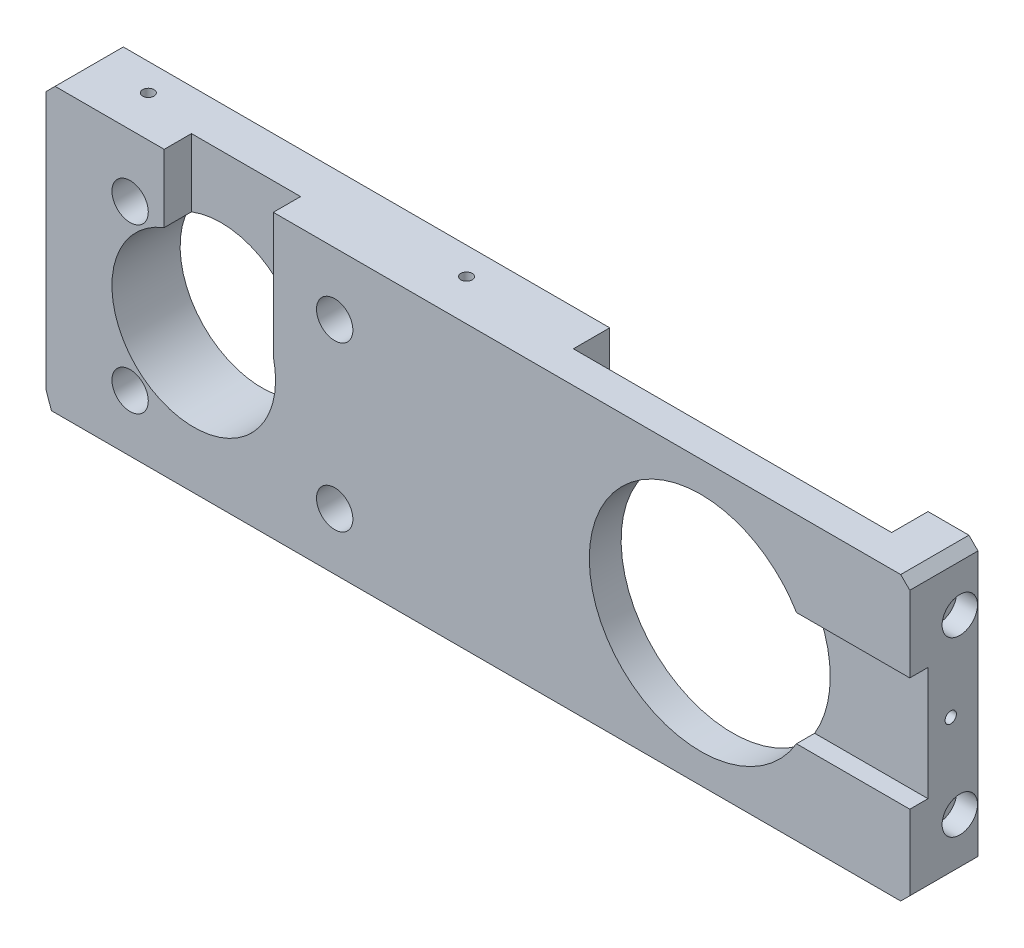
ISO-10303-21;
HEADER;
FILE_DESCRIPTION(('STEP AP214'),'2;1');
FILE_NAME('part.step','',(''),(''),'','','');
FILE_SCHEMA(('AUTOMOTIVE_DESIGN { 1 0 10303 214 1 1 1 1 }'));
ENDSEC;
DATA;
#1=APPLICATION_CONTEXT('core data for automotive mechanical design processes');
#2=APPLICATION_PROTOCOL_DEFINITION('international standard','automotive_design',2000,#1);
#3=PRODUCT_CONTEXT('',#1,'mechanical');
#4=PRODUCT('Part','Part','',(#3));
#5=PRODUCT_RELATED_PRODUCT_CATEGORY('part','',(#4));
#6=PRODUCT_DEFINITION_FORMATION('','',#4);
#7=PRODUCT_DEFINITION_CONTEXT('part definition',#1,'design');
#8=PRODUCT_DEFINITION('design','',#6,#7);
#9=PRODUCT_DEFINITION_SHAPE('','',#8);
#10=(LENGTH_UNIT() NAMED_UNIT(*) SI_UNIT(.MILLI.,.METRE.));
#11=(NAMED_UNIT(*) PLANE_ANGLE_UNIT() SI_UNIT($,.RADIAN.));
#12=(NAMED_UNIT(*) SI_UNIT($,.STERADIAN.) SOLID_ANGLE_UNIT());
#13=UNCERTAINTY_MEASURE_WITH_UNIT(LENGTH_MEASURE(1.E-05),#10,'distance_accuracy_value','');
#14=(GEOMETRIC_REPRESENTATION_CONTEXT(3) GLOBAL_UNCERTAINTY_ASSIGNED_CONTEXT((#13)) GLOBAL_UNIT_ASSIGNED_CONTEXT((#10,
#11,#12)) REPRESENTATION_CONTEXT('',''));
#15=CARTESIAN_POINT('',(0.,0.,0.));
#16=DIRECTION('',(0.,0.,1.));
#17=DIRECTION('',(1.,0.,0.));
#18=AXIS2_PLACEMENT_3D('',#15,#16,#17);
#19=CARTESIAN_POINT('',(223.283416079,0.44785571,12.));
#20=DIRECTION('',(0.,0.,1.));
#21=DIRECTION('',(1.,0.,0.));
#22=AXIS2_PLACEMENT_3D('',#19,#20,#21);
#23=PLANE('',#22);
#24=DIRECTION('',(-1.,0.,0.));
#25=VECTOR('',#24,1.);
#26=CARTESIAN_POINT('',(229.102416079,0.44785571,12.));
#27=LINE('',#26,#25);
#28=CARTESIAN_POINT('',(232.602416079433,0.447855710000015,12.));
#29=VERTEX_POINT('',#28);
#30=CARTESIAN_POINT('',(225.602416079,0.447855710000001,12.));
#31=VERTEX_POINT('',#30);
#32=EDGE_CURVE('E270',#29,#31,#27,.T.);
#33=ORIENTED_EDGE('',*,*,#32,.T.);
#34=CARTESIAN_POINT('',(225.602416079,2.69785571,12.));
#35=DIRECTION('',(0.,0.,-1.));
#36=DIRECTION('',(-1.,0.,0.));
#37=AXIS2_PLACEMENT_3D('',#34,#35,#36);
#38=CIRCLE('',#37,2.24999999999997);
#39=CARTESIAN_POINT('',(225.602416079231,4.94785570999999,12.));
#40=VERTEX_POINT('',#39);
#41=EDGE_CURVE('E21',#40,#31,#38,.F.);
#42=ORIENTED_EDGE('',*,*,#41,.F.);
#43=DIRECTION('',(1.,0.,0.));
#44=VECTOR('',#43,1.);
#45=CARTESIAN_POINT('',(229.102416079,4.94785571,12.));
#46=LINE('',#45,#44);
#47=CARTESIAN_POINT('',(232.602416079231,4.94785570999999,12.));
#48=VERTEX_POINT('',#47);
#49=EDGE_CURVE('E268',#40,#48,#46,.T.);
#50=ORIENTED_EDGE('',*,*,#49,.T.);
#51=CARTESIAN_POINT('',(232.602416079,2.69785571,12.));
#52=DIRECTION('',(0.,0.,-1.));
#53=DIRECTION('',(-1.,0.,0.));
#54=AXIS2_PLACEMENT_3D('',#51,#52,#53);
#55=CIRCLE('',#54,2.24999999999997);
#56=EDGE_CURVE('E330',#29,#48,#55,.F.);
#57=ORIENTED_EDGE('',*,*,#56,.F.);
#58=EDGE_LOOP('',(#33,#42,#50,#57));
#59=FACE_BOUND('',#58,.T.);
#60=ADVANCED_FACE('F17',(#59),#23,.F.);
#61=CARTESIAN_POINT('',(223.283416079,52.44785571,12.));
#62=DIRECTION('',(0.,0.,1.));
#63=DIRECTION('',(1.,0.,0.));
#64=AXIS2_PLACEMENT_3D('',#61,#62,#63);
#65=PLANE('',#64);
#66=DIRECTION('',(-1.,0.,0.));
#67=VECTOR('',#66,1.);
#68=CARTESIAN_POINT('',(229.102416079,52.44785571,12.));
#69=LINE('',#68,#67);
#70=CARTESIAN_POINT('',(232.602416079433,52.44785571,12.));
#71=VERTEX_POINT('',#70);
#72=CARTESIAN_POINT('',(225.602416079,52.44785571,12.));
#73=VERTEX_POINT('',#72);
#74=EDGE_CURVE('E322',#71,#73,#69,.T.);
#75=ORIENTED_EDGE('',*,*,#74,.T.);
#76=CARTESIAN_POINT('',(225.602416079,54.69785571,12.));
#77=DIRECTION('',(0.,0.,-1.));
#78=DIRECTION('',(-1.,0.,0.));
#79=AXIS2_PLACEMENT_3D('',#76,#77,#78);
#80=CIRCLE('',#79,2.24999999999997);
#81=CARTESIAN_POINT('',(225.602416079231,56.94785571,12.));
#82=VERTEX_POINT('',#81);
#83=EDGE_CURVE('E326',#82,#73,#80,.F.);
#84=ORIENTED_EDGE('',*,*,#83,.F.);
#85=DIRECTION('',(1.,0.,0.));
#86=VECTOR('',#85,1.);
#87=CARTESIAN_POINT('',(229.102416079,56.94785571,12.));
#88=LINE('',#87,#86);
#89=CARTESIAN_POINT('',(232.602416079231,56.94785571,12.));
#90=VERTEX_POINT('',#89);
#91=EDGE_CURVE('E327',#82,#90,#88,.T.);
#92=ORIENTED_EDGE('',*,*,#91,.T.);
#93=CARTESIAN_POINT('',(232.602416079,54.69785571,12.));
#94=DIRECTION('',(0.,0.,-1.));
#95=DIRECTION('',(-1.,0.,0.));
#96=AXIS2_PLACEMENT_3D('',#93,#94,#95);
#97=CIRCLE('',#96,2.24999999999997);
#98=EDGE_CURVE('E321',#71,#90,#97,.F.);
#99=ORIENTED_EDGE('',*,*,#98,.F.);
#100=EDGE_LOOP('',(#75,#84,#92,#99));
#101=FACE_BOUND('',#100,.T.);
#102=ADVANCED_FACE('F987',(#101),#65,.F.);
#103=CARTESIAN_POINT('',(191.283416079,52.44785571,12.));
#104=DIRECTION('',(0.,0.,1.));
#105=DIRECTION('',(1.,0.,0.));
#106=AXIS2_PLACEMENT_3D('',#103,#104,#105);
#107=PLANE('',#106);
#108=DIRECTION('',(-1.,0.,0.));
#109=VECTOR('',#108,1.);
#110=CARTESIAN_POINT('',(197.102416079,52.44785571,12.));
#111=LINE('',#110,#109);
#112=CARTESIAN_POINT('',(200.602416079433,52.44785571,12.));
#113=VERTEX_POINT('',#112);
#114=CARTESIAN_POINT('',(193.602416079,52.44785571,12.));
#115=VERTEX_POINT('',#114);
#116=EDGE_CURVE('E313',#113,#115,#111,.T.);
#117=ORIENTED_EDGE('',*,*,#116,.T.);
#118=CARTESIAN_POINT('',(193.602416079,54.69785571,12.));
#119=DIRECTION('',(0.,0.,-1.));
#120=DIRECTION('',(-1.,0.,0.));
#121=AXIS2_PLACEMENT_3D('',#118,#119,#120);
#122=CIRCLE('',#121,2.24999999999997);
#123=CARTESIAN_POINT('',(193.602416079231,56.94785571,12.));
#124=VERTEX_POINT('',#123);
#125=EDGE_CURVE('E317',#124,#115,#122,.F.);
#126=ORIENTED_EDGE('',*,*,#125,.F.);
#127=DIRECTION('',(1.,0.,0.));
#128=VECTOR('',#127,1.);
#129=CARTESIAN_POINT('',(197.102416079,56.94785571,12.));
#130=LINE('',#129,#128);
#131=CARTESIAN_POINT('',(200.602416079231,56.94785571,12.));
#132=VERTEX_POINT('',#131);
#133=EDGE_CURVE('E318',#124,#132,#130,.T.);
#134=ORIENTED_EDGE('',*,*,#133,.T.);
#135=CARTESIAN_POINT('',(200.602416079,54.69785571,12.));
#136=DIRECTION('',(0.,0.,-1.));
#137=DIRECTION('',(-1.,0.,0.));
#138=AXIS2_PLACEMENT_3D('',#135,#136,#137);
#139=CIRCLE('',#138,2.24999999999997);
#140=EDGE_CURVE('E312',#113,#132,#139,.F.);
#141=ORIENTED_EDGE('',*,*,#140,.F.);
#142=EDGE_LOOP('',(#117,#126,#134,#141));
#143=FACE_BOUND('',#142,.T.);
#144=ADVANCED_FACE('F990',(#143),#107,.F.);
#145=CARTESIAN_POINT('',(191.283416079,0.44785571,12.));
#146=DIRECTION('',(0.,0.,1.));
#147=DIRECTION('',(1.,0.,0.));
#148=AXIS2_PLACEMENT_3D('',#145,#146,#147);
#149=PLANE('',#148);
#150=DIRECTION('',(-1.,0.,0.));
#151=VECTOR('',#150,1.);
#152=CARTESIAN_POINT('',(197.102416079,0.44785571,12.));
#153=LINE('',#152,#151);
#154=CARTESIAN_POINT('',(200.602416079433,0.447855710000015,12.));
#155=VERTEX_POINT('',#154);
#156=CARTESIAN_POINT('',(193.602416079,0.447855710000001,12.));
#157=VERTEX_POINT('',#156);
#158=EDGE_CURVE('E304',#155,#157,#153,.T.);
#159=ORIENTED_EDGE('',*,*,#158,.T.);
#160=CARTESIAN_POINT('',(193.602416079,2.69785571,12.));
#161=DIRECTION('',(0.,0.,-1.));
#162=DIRECTION('',(-1.,0.,0.));
#163=AXIS2_PLACEMENT_3D('',#160,#161,#162);
#164=CIRCLE('',#163,2.24999999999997);
#165=CARTESIAN_POINT('',(193.602416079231,4.94785570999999,12.));
#166=VERTEX_POINT('',#165);
#167=EDGE_CURVE('E308',#166,#157,#164,.F.);
#168=ORIENTED_EDGE('',*,*,#167,.F.);
#169=DIRECTION('',(1.,0.,0.));
#170=VECTOR('',#169,1.);
#171=CARTESIAN_POINT('',(197.102416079,4.94785571,12.));
#172=LINE('',#171,#170);
#173=CARTESIAN_POINT('',(200.602416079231,4.94785570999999,12.));
#174=VERTEX_POINT('',#173);
#175=EDGE_CURVE('E309',#166,#174,#172,.T.);
#176=ORIENTED_EDGE('',*,*,#175,.T.);
#177=CARTESIAN_POINT('',(200.602416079,2.69785571,12.));
#178=DIRECTION('',(0.,0.,-1.));
#179=DIRECTION('',(-1.,0.,0.));
#180=AXIS2_PLACEMENT_3D('',#177,#178,#179);
#181=CIRCLE('',#180,2.24999999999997);
#182=EDGE_CURVE('E303',#155,#174,#181,.F.);
#183=ORIENTED_EDGE('',*,*,#182,.F.);
#184=EDGE_LOOP('',(#159,#168,#176,#183));
#185=FACE_BOUND('',#184,.T.);
#186=ADVANCED_FACE('F983',(#185),#149,.F.);
#187=CARTESIAN_POINT('',(82.602416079,5.948931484,6.));
#188=DIRECTION('',(0.,-1.,0.));
#189=DIRECTION('',(0.,0.,-1.));
#190=AXIS2_PLACEMENT_3D('',#187,#188,#189);
#191=CONICAL_SURFACE('',#190,0.,1.02974425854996);
#192=CARTESIAN_POINT('',(82.602416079,5.948931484,6.));
#193=VERTEX_POINT('',#192);
#194=VERTEX_LOOP('',#193);
#195=FACE_BOUND('',#194,.T.);
#196=CARTESIAN_POINT('',(82.602416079,5.19785571,6.));
#197=DIRECTION('',(0.,-1.,0.));
#198=DIRECTION('',(0.,0.,-1.));
#199=AXIS2_PLACEMENT_3D('',#196,#197,#198);
#200=CIRCLE('',#199,1.25);
#201=CARTESIAN_POINT('',(82.602416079,5.19785571,4.75));
#202=VERTEX_POINT('',#201);
#203=EDGE_CURVE('E300',#202,#202,#200,.F.);
#204=ORIENTED_EDGE('',*,*,#203,.F.);
#205=EDGE_LOOP('',(#204));
#206=FACE_BOUND('',#205,.T.);
#207=ADVANCED_FACE('F979',(#195,#206),#191,.F.);
#208=CARTESIAN_POINT('',(152.602416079,5.948931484,6.));
#209=DIRECTION('',(0.,-1.,0.));
#210=DIRECTION('',(0.,0.,-1.));
#211=AXIS2_PLACEMENT_3D('',#208,#209,#210);
#212=CONICAL_SURFACE('',#211,0.,1.02974425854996);
#213=CARTESIAN_POINT('',(152.602416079,5.948931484,6.));
#214=VERTEX_POINT('',#213);
#215=VERTEX_LOOP('',#214);
#216=FACE_BOUND('',#215,.T.);
#217=CARTESIAN_POINT('',(152.602416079,5.19785571,6.));
#218=DIRECTION('',(0.,-1.,0.));
#219=DIRECTION('',(0.,0.,-1.));
#220=AXIS2_PLACEMENT_3D('',#217,#218,#219);
#221=CIRCLE('',#220,1.25);
#222=CARTESIAN_POINT('',(152.602416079,5.19785571,4.75));
#223=VERTEX_POINT('',#222);
#224=EDGE_CURVE('E297',#223,#223,#221,.F.);
#225=ORIENTED_EDGE('',*,*,#224,.F.);
#226=EDGE_LOOP('',(#225));
#227=FACE_BOUND('',#226,.T.);
#228=ADVANCED_FACE('F975',(#216,#227),#212,.F.);
#229=CARTESIAN_POINT('',(77.353491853,29.19785571,6.));
#230=DIRECTION('',(-1.,0.,0.));
#231=DIRECTION('',(0.,-1.,0.));
#232=AXIS2_PLACEMENT_3D('',#229,#230,#231);
#233=CONICAL_SURFACE('',#232,0.,1.02974425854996);
#234=CARTESIAN_POINT('',(77.353491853,29.19785571,6.));
#235=VERTEX_POINT('',#234);
#236=VERTEX_LOOP('',#235);
#237=FACE_BOUND('',#236,.T.);
#238=CARTESIAN_POINT('',(76.602416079,29.19785571,6.));
#239=DIRECTION('',(-1.,0.,0.));
#240=DIRECTION('',(0.,0.,1.));
#241=AXIS2_PLACEMENT_3D('',#238,#239,#240);
#242=CIRCLE('',#241,1.25);
#243=CARTESIAN_POINT('',(76.602416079,29.19785571,7.25));
#244=VERTEX_POINT('',#243);
#245=EDGE_CURVE('E294',#244,#244,#242,.F.);
#246=ORIENTED_EDGE('',*,*,#245,.F.);
#247=EDGE_LOOP('',(#246));
#248=FACE_BOUND('',#247,.T.);
#249=ADVANCED_FACE('F971',(#237,#248),#233,.F.);
#250=CARTESIAN_POINT('',(152.602416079,51.646779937,6.));
#251=DIRECTION('',(0.,1.,0.));
#252=DIRECTION('',(-1.,0.,0.));
#253=AXIS2_PLACEMENT_3D('',#250,#251,#252);
#254=CONICAL_SURFACE('',#253,0.,1.02974425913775);
#255=CARTESIAN_POINT('',(152.602416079,51.646779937,6.));
#256=VERTEX_POINT('',#255);
#257=VERTEX_LOOP('',#256);
#258=FACE_BOUND('',#257,.T.);
#259=CARTESIAN_POINT('',(152.602416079,52.39785571,6.));
#260=DIRECTION('',(0.,1.,0.));
#261=DIRECTION('',(0.,0.,1.));
#262=AXIS2_PLACEMENT_3D('',#259,#260,#261);
#263=CIRCLE('',#262,1.25);
#264=CARTESIAN_POINT('',(152.602416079,52.39785571,7.25));
#265=VERTEX_POINT('',#264);
#266=EDGE_CURVE('E291',#265,#265,#263,.F.);
#267=ORIENTED_EDGE('',*,*,#266,.F.);
#268=EDGE_LOOP('',(#267));
#269=FACE_BOUND('',#268,.T.);
#270=ADVANCED_FACE('F967',(#258,#269),#254,.F.);
#271=CARTESIAN_POINT('',(82.602416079,51.646779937,6.));
#272=DIRECTION('',(0.,1.,0.));
#273=DIRECTION('',(-1.,0.,0.));
#274=AXIS2_PLACEMENT_3D('',#271,#272,#273);
#275=CONICAL_SURFACE('',#274,0.,1.02974425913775);
#276=CARTESIAN_POINT('',(82.602416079,51.646779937,6.));
#277=VERTEX_POINT('',#276);
#278=VERTEX_LOOP('',#277);
#279=FACE_BOUND('',#278,.T.);
#280=CARTESIAN_POINT('',(82.602416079,52.39785571,6.));
#281=DIRECTION('',(0.,1.,0.));
#282=DIRECTION('',(0.,0.,1.));
#283=AXIS2_PLACEMENT_3D('',#280,#281,#282);
#284=CIRCLE('',#283,1.25);
#285=CARTESIAN_POINT('',(82.602416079,52.39785571,7.25));
#286=VERTEX_POINT('',#285);
#287=EDGE_CURVE('E287',#286,#286,#284,.F.);
#288=ORIENTED_EDGE('',*,*,#287,.F.);
#289=EDGE_LOOP('',(#288));
#290=FACE_BOUND('',#289,.T.);
#291=ADVANCED_FACE('F963',(#279,#290),#275,.F.);
#292=CARTESIAN_POINT('',(132.602416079,46.19785571,0.));
#293=DIRECTION('',(0.,0.,1.));
#294=DIRECTION('',(1.,0.,0.));
#295=AXIS2_PLACEMENT_3D('',#292,#293,#294);
#296=CYLINDRICAL_SURFACE('',#295,2.25000000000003);
#297=CARTESIAN_POINT('',(132.602416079,46.19785571,0.));
#298=DIRECTION('',(0.,0.,1.));
#299=DIRECTION('',(1.,0.,0.));
#300=AXIS2_PLACEMENT_3D('',#297,#298,#299);
#301=CIRCLE('',#300,2.25000000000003);
#302=CARTESIAN_POINT('',(134.852416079,46.19785571,0.));
#303=VERTEX_POINT('',#302);
#304=EDGE_CURVE('E509',#303,#303,#301,.T.);
#305=ORIENTED_EDGE('',*,*,#304,.F.);
#306=EDGE_LOOP('',(#305));
#307=FACE_BOUND('',#306,.T.);
#308=CARTESIAN_POINT('',(132.602416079,46.19785571,7.));
#309=DIRECTION('',(0.,0.,1.));
#310=DIRECTION('',(1.,0.,0.));
#311=AXIS2_PLACEMENT_3D('',#308,#309,#310);
#312=CIRCLE('',#311,2.25000000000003);
#313=CARTESIAN_POINT('',(134.852416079,46.19785571,7.));
#314=VERTEX_POINT('',#313);
#315=EDGE_CURVE('E497',#314,#314,#312,.T.);
#316=ORIENTED_EDGE('',*,*,#315,.T.);
#317=EDGE_LOOP('',(#316));
#318=FACE_BOUND('',#317,.T.);
#319=ADVANCED_FACE('F959',(#307,#318),#296,.F.);
#320=CARTESIAN_POINT('',(132.602416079,10.19785571,0.));
#321=DIRECTION('',(0.,0.,1.));
#322=DIRECTION('',(1.,0.,0.));
#323=AXIS2_PLACEMENT_3D('',#320,#321,#322);
#324=CYLINDRICAL_SURFACE('',#323,2.25000000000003);
#325=CARTESIAN_POINT('',(132.602416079,10.19785571,0.));
#326=DIRECTION('',(0.,0.,1.));
#327=DIRECTION('',(1.,0.,0.));
#328=AXIS2_PLACEMENT_3D('',#325,#326,#327);
#329=CIRCLE('',#328,2.25000000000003);
#330=CARTESIAN_POINT('',(134.852416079,10.19785571,0.));
#331=VERTEX_POINT('',#330);
#332=EDGE_CURVE('E506',#331,#331,#329,.T.);
#333=ORIENTED_EDGE('',*,*,#332,.F.);
#334=EDGE_LOOP('',(#333));
#335=FACE_BOUND('',#334,.T.);
#336=CARTESIAN_POINT('',(132.602416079,10.19785571,7.));
#337=DIRECTION('',(0.,0.,1.));
#338=DIRECTION('',(1.,0.,0.));
#339=AXIS2_PLACEMENT_3D('',#336,#337,#338);
#340=CIRCLE('',#339,2.25000000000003);
#341=CARTESIAN_POINT('',(134.852416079,10.19785571,7.));
#342=VERTEX_POINT('',#341);
#343=EDGE_CURVE('E494',#342,#342,#340,.T.);
#344=ORIENTED_EDGE('',*,*,#343,.T.);
#345=EDGE_LOOP('',(#344));
#346=FACE_BOUND('',#345,.T.);
#347=ADVANCED_FACE('F955',(#335,#346),#324,.F.);
#348=CARTESIAN_POINT('',(87.602416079,10.19785571,0.));
#349=DIRECTION('',(0.,0.,1.));
#350=DIRECTION('',(1.,0.,0.));
#351=AXIS2_PLACEMENT_3D('',#348,#349,#350);
#352=CYLINDRICAL_SURFACE('',#351,2.25);
#353=CARTESIAN_POINT('',(87.602416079,10.19785571,0.));
#354=DIRECTION('',(0.,0.,1.));
#355=DIRECTION('',(1.,0.,0.));
#356=AXIS2_PLACEMENT_3D('',#353,#354,#355);
#357=CIRCLE('',#356,2.25);
#358=CARTESIAN_POINT('',(89.852416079,10.19785571,0.));
#359=VERTEX_POINT('',#358);
#360=EDGE_CURVE('E503',#359,#359,#357,.T.);
#361=ORIENTED_EDGE('',*,*,#360,.F.);
#362=EDGE_LOOP('',(#361));
#363=FACE_BOUND('',#362,.T.);
#364=CARTESIAN_POINT('',(87.602416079,10.19785571,7.));
#365=DIRECTION('',(0.,0.,1.));
#366=DIRECTION('',(1.,0.,0.));
#367=AXIS2_PLACEMENT_3D('',#364,#365,#366);
#368=CIRCLE('',#367,2.25);
#369=CARTESIAN_POINT('',(89.852416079,10.19785571,7.));
#370=VERTEX_POINT('',#369);
#371=EDGE_CURVE('E491',#370,#370,#368,.T.);
#372=ORIENTED_EDGE('',*,*,#371,.T.);
#373=EDGE_LOOP('',(#372));
#374=FACE_BOUND('',#373,.T.);
#375=ADVANCED_FACE('F951',(#363,#374),#352,.F.);
#376=CARTESIAN_POINT('',(87.602416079,46.19785571,0.));
#377=DIRECTION('',(0.,0.,1.));
#378=DIRECTION('',(1.,0.,0.));
#379=AXIS2_PLACEMENT_3D('',#376,#377,#378);
#380=CYLINDRICAL_SURFACE('',#379,2.25);
#381=CARTESIAN_POINT('',(87.602416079,46.19785571,0.));
#382=DIRECTION('',(0.,0.,1.));
#383=DIRECTION('',(1.,0.,0.));
#384=AXIS2_PLACEMENT_3D('',#381,#382,#383);
#385=CIRCLE('',#384,2.25);
#386=CARTESIAN_POINT('',(89.852416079,46.19785571,0.));
#387=VERTEX_POINT('',#386);
#388=EDGE_CURVE('E500',#387,#387,#385,.T.);
#389=ORIENTED_EDGE('',*,*,#388,.F.);
#390=EDGE_LOOP('',(#389));
#391=FACE_BOUND('',#390,.T.);
#392=CARTESIAN_POINT('',(87.602416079,46.19785571,7.));
#393=DIRECTION('',(0.,0.,1.));
#394=DIRECTION('',(1.,0.,0.));
#395=AXIS2_PLACEMENT_3D('',#392,#393,#394);
#396=CIRCLE('',#395,2.25);
#397=CARTESIAN_POINT('',(89.852416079,46.19785571,7.));
#398=VERTEX_POINT('',#397);
#399=EDGE_CURVE('E487',#398,#398,#396,.T.);
#400=ORIENTED_EDGE('',*,*,#399,.T.);
#401=EDGE_LOOP('',(#400));
#402=FACE_BOUND('',#401,.T.);
#403=ADVANCED_FACE('F948',(#391,#402),#380,.F.);
#404=CARTESIAN_POINT('',(225.602416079,4.94785571,8.));
#405=DIRECTION('',(0.,1.,0.));
#406=DIRECTION('',(0.,0.,1.));
#407=AXIS2_PLACEMENT_3D('',#404,#405,#406);
#408=PLANE('',#407);
#409=DIRECTION('',(0.,0.,1.));
#410=VECTOR('',#409,1.);
#411=CARTESIAN_POINT('',(232.602416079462,4.94785570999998,10.));
#412=LINE('',#411,#410);
#413=CARTESIAN_POINT('',(232.602416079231,4.94785572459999,8.));
#414=VERTEX_POINT('',#413);
#415=EDGE_CURVE('E277',#48,#414,#412,.F.);
#416=ORIENTED_EDGE('',*,*,#415,.F.);
#417=ORIENTED_EDGE('',*,*,#49,.F.);
#418=DIRECTION('',(0.,0.,-1.));
#419=VECTOR('',#418,1.);
#420=CARTESIAN_POINT('',(225.602416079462,4.94785570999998,10.));
#421=LINE('',#420,#419);
#422=CARTESIAN_POINT('',(225.602416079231,4.94785572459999,8.));
#423=VERTEX_POINT('',#422);
#424=EDGE_CURVE('E271',#423,#40,#421,.F.);
#425=ORIENTED_EDGE('',*,*,#424,.F.);
#426=DIRECTION('',(-1.,0.,0.));
#427=VECTOR('',#426,1.);
#428=CARTESIAN_POINT('',(213.102416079,4.9478557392,8.));
#429=LINE('',#428,#427);
#430=EDGE_CURVE('E486',#414,#423,#429,.T.);
#431=ORIENTED_EDGE('',*,*,#430,.F.);
#432=EDGE_LOOP('',(#416,#417,#425,#431));
#433=FACE_BOUND('',#432,.T.);
#434=ADVANCED_FACE('F275',(#433),#408,.F.);
#435=CARTESIAN_POINT('',(225.602416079,2.69785571,12.));
#436=DIRECTION('',(0.,0.,-1.));
#437=DIRECTION('',(-1.,0.,0.));
#438=AXIS2_PLACEMENT_3D('',#435,#436,#437);
#439=CYLINDRICAL_SURFACE('',#438,2.24999999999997);
#440=DIRECTION('',(0.,0.,-1.));
#441=VECTOR('',#440,1.);
#442=CARTESIAN_POINT('',(225.602416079,0.44785571,10.));
#443=LINE('',#442,#441);
#444=CARTESIAN_POINT('',(225.602416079,0.447855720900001,8.));
#445=VERTEX_POINT('',#444);
#446=EDGE_CURVE('E285',#31,#445,#443,.T.);
#447=ORIENTED_EDGE('',*,*,#446,.T.);
#448=CARTESIAN_POINT('',(225.602416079,2.69785571,8.));
#449=DIRECTION('',(0.,0.,-1.));
#450=DIRECTION('',(-1.,0.,0.));
#451=AXIS2_PLACEMENT_3D('',#448,#449,#450);
#452=CIRCLE('',#451,2.24999999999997);
#453=EDGE_CURVE('E280',#423,#445,#452,.F.);
#454=ORIENTED_EDGE('',*,*,#453,.F.);
#455=ORIENTED_EDGE('',*,*,#424,.T.);
#456=ORIENTED_EDGE('',*,*,#41,.T.);
#457=EDGE_LOOP('',(#447,#454,#455,#456));
#458=FACE_BOUND('',#457,.T.);
#459=ADVANCED_FACE('F279',(#458),#439,.F.);
#460=CARTESIAN_POINT('',(225.602416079,0.44785571,12.));
#461=DIRECTION('',(0.,-1.,0.));
#462=DIRECTION('',(0.,0.,-1.));
#463=AXIS2_PLACEMENT_3D('',#460,#461,#462);
#464=PLANE('',#463);
#465=ORIENTED_EDGE('',*,*,#446,.F.);
#466=ORIENTED_EDGE('',*,*,#32,.F.);
#467=DIRECTION('',(0.,0.,-1.));
#468=VECTOR('',#467,1.);
#469=CARTESIAN_POINT('',(232.602416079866,0.447855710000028,10.));
#470=LINE('',#469,#468);
#471=CARTESIAN_POINT('',(232.602416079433,0.447855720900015,8.));
#472=VERTEX_POINT('',#471);
#473=EDGE_CURVE('E523',#472,#29,#470,.F.);
#474=ORIENTED_EDGE('',*,*,#473,.F.);
#475=DIRECTION('',(1.,0.,0.));
#476=VECTOR('',#475,1.);
#477=CARTESIAN_POINT('',(213.102416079,0.447855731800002,8.));
#478=LINE('',#477,#476);
#479=EDGE_CURVE('E484',#445,#472,#478,.T.);
#480=ORIENTED_EDGE('',*,*,#479,.F.);
#481=EDGE_LOOP('',(#465,#466,#474,#480));
#482=FACE_BOUND('',#481,.T.);
#483=ADVANCED_FACE('F945',(#482),#464,.F.);
#484=CARTESIAN_POINT('',(232.602416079,2.69785571,12.));
#485=DIRECTION('',(0.,0.,-1.));
#486=DIRECTION('',(-1.,0.,0.));
#487=AXIS2_PLACEMENT_3D('',#484,#485,#486);
#488=CYLINDRICAL_SURFACE('',#487,2.24999999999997);
#489=ORIENTED_EDGE('',*,*,#473,.T.);
#490=ORIENTED_EDGE('',*,*,#56,.T.);
#491=ORIENTED_EDGE('',*,*,#415,.T.);
#492=CARTESIAN_POINT('',(232.602416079,2.69785571,8.));
#493=DIRECTION('',(0.,0.,-1.));
#494=DIRECTION('',(-1.,0.,0.));
#495=AXIS2_PLACEMENT_3D('',#492,#493,#494);
#496=CIRCLE('',#495,2.24999999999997);
#497=EDGE_CURVE('E481',#472,#414,#496,.F.);
#498=ORIENTED_EDGE('',*,*,#497,.F.);
#499=EDGE_LOOP('',(#489,#490,#491,#498));
#500=FACE_BOUND('',#499,.T.);
#501=ADVANCED_FACE('F942',(#500),#488,.F.);
#502=CARTESIAN_POINT('',(225.602416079,56.94785571,8.));
#503=DIRECTION('',(0.,1.,0.));
#504=DIRECTION('',(0.,0.,1.));
#505=AXIS2_PLACEMENT_3D('',#502,#503,#504);
#506=PLANE('',#505);
#507=DIRECTION('',(0.,0.,1.));
#508=VECTOR('',#507,1.);
#509=CARTESIAN_POINT('',(232.602416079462,56.94785571,10.));
#510=LINE('',#509,#508);
#511=CARTESIAN_POINT('',(232.602416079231,56.9478557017,8.));
#512=VERTEX_POINT('',#511);
#513=EDGE_CURVE('E534',#90,#512,#510,.F.);
#514=ORIENTED_EDGE('',*,*,#513,.F.);
#515=ORIENTED_EDGE('',*,*,#91,.F.);
#516=DIRECTION('',(0.,0.,-1.));
#517=VECTOR('',#516,1.);
#518=CARTESIAN_POINT('',(225.602416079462,56.94785571,10.));
#519=LINE('',#518,#517);
#520=CARTESIAN_POINT('',(225.602416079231,56.9478557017,8.));
#521=VERTEX_POINT('',#520);
#522=EDGE_CURVE('E329',#521,#82,#519,.F.);
#523=ORIENTED_EDGE('',*,*,#522,.F.);
#524=DIRECTION('',(-1.,0.,0.));
#525=VECTOR('',#524,1.);
#526=CARTESIAN_POINT('',(213.102416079,56.9478556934,8.));
#527=LINE('',#526,#525);
#528=EDGE_CURVE('E480',#512,#521,#527,.T.);
#529=ORIENTED_EDGE('',*,*,#528,.F.);
#530=EDGE_LOOP('',(#514,#515,#523,#529));
#531=FACE_BOUND('',#530,.T.);
#532=ADVANCED_FACE('F940',(#531),#506,.F.);
#533=CARTESIAN_POINT('',(225.602416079,54.69785571,12.));
#534=DIRECTION('',(0.,0.,-1.));
#535=DIRECTION('',(-1.,0.,0.));
#536=AXIS2_PLACEMENT_3D('',#533,#534,#535);
#537=CYLINDRICAL_SURFACE('',#536,2.24999999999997);
#538=DIRECTION('',(0.,0.,-1.));
#539=VECTOR('',#538,1.);
#540=CARTESIAN_POINT('',(225.602416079,52.44785571,10.));
#541=LINE('',#540,#539);
#542=CARTESIAN_POINT('',(225.602416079,52.447855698,8.));
#543=VERTEX_POINT('',#542);
#544=EDGE_CURVE('E325',#73,#543,#541,.T.);
#545=ORIENTED_EDGE('',*,*,#544,.T.);
#546=CARTESIAN_POINT('',(225.602416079,54.69785571,8.));
#547=DIRECTION('',(0.,0.,-1.));
#548=DIRECTION('',(-1.,0.,0.));
#549=AXIS2_PLACEMENT_3D('',#546,#547,#548);
#550=CIRCLE('',#549,2.24999999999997);
#551=EDGE_CURVE('E478',#521,#543,#550,.F.);
#552=ORIENTED_EDGE('',*,*,#551,.F.);
#553=ORIENTED_EDGE('',*,*,#522,.T.);
#554=ORIENTED_EDGE('',*,*,#83,.T.);
#555=EDGE_LOOP('',(#545,#552,#553,#554));
#556=FACE_BOUND('',#555,.T.);
#557=ADVANCED_FACE('F937',(#556),#537,.F.);
#558=CARTESIAN_POINT('',(225.602416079,52.44785571,12.));
#559=DIRECTION('',(0.,-1.,0.));
#560=DIRECTION('',(0.,0.,-1.));
#561=AXIS2_PLACEMENT_3D('',#558,#559,#560);
#562=PLANE('',#561);
#563=ORIENTED_EDGE('',*,*,#544,.F.);
#564=ORIENTED_EDGE('',*,*,#74,.F.);
#565=DIRECTION('',(0.,0.,-1.));
#566=VECTOR('',#565,1.);
#567=CARTESIAN_POINT('',(232.602416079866,52.44785571,10.));
#568=LINE('',#567,#566);
#569=CARTESIAN_POINT('',(232.602416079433,52.447855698,8.));
#570=VERTEX_POINT('',#569);
#571=EDGE_CURVE('E522',#570,#71,#568,.F.);
#572=ORIENTED_EDGE('',*,*,#571,.F.);
#573=DIRECTION('',(1.,0.,0.));
#574=VECTOR('',#573,1.);
#575=CARTESIAN_POINT('',(213.102416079,52.447855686,8.));
#576=LINE('',#575,#574);
#577=EDGE_CURVE('E477',#543,#570,#576,.T.);
#578=ORIENTED_EDGE('',*,*,#577,.F.);
#579=EDGE_LOOP('',(#563,#564,#572,#578));
#580=FACE_BOUND('',#579,.T.);
#581=ADVANCED_FACE('F935',(#580),#562,.F.);
#582=CARTESIAN_POINT('',(232.602416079,54.69785571,12.));
#583=DIRECTION('',(0.,0.,-1.));
#584=DIRECTION('',(-1.,0.,0.));
#585=AXIS2_PLACEMENT_3D('',#582,#583,#584);
#586=CYLINDRICAL_SURFACE('',#585,2.24999999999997);
#587=ORIENTED_EDGE('',*,*,#571,.T.);
#588=ORIENTED_EDGE('',*,*,#98,.T.);
#589=ORIENTED_EDGE('',*,*,#513,.T.);
#590=CARTESIAN_POINT('',(232.602416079,54.69785571,8.));
#591=DIRECTION('',(0.,0.,-1.));
#592=DIRECTION('',(-1.,0.,0.));
#593=AXIS2_PLACEMENT_3D('',#590,#591,#592);
#594=CIRCLE('',#593,2.24999999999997);
#595=EDGE_CURVE('E474',#570,#512,#594,.F.);
#596=ORIENTED_EDGE('',*,*,#595,.F.);
#597=EDGE_LOOP('',(#587,#588,#589,#596));
#598=FACE_BOUND('',#597,.T.);
#599=ADVANCED_FACE('F932',(#598),#586,.F.);
#600=CARTESIAN_POINT('',(193.602416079,56.94785571,8.));
#601=DIRECTION('',(0.,1.,0.));
#602=DIRECTION('',(0.,0.,1.));
#603=AXIS2_PLACEMENT_3D('',#600,#601,#602);
#604=PLANE('',#603);
#605=DIRECTION('',(0.,0.,1.));
#606=VECTOR('',#605,1.);
#607=CARTESIAN_POINT('',(200.602416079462,56.94785571,10.));
#608=LINE('',#607,#606);
#609=CARTESIAN_POINT('',(200.602416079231,56.9478557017,8.));
#610=VERTEX_POINT('',#609);
#611=EDGE_CURVE('E542',#132,#610,#608,.F.);
#612=ORIENTED_EDGE('',*,*,#611,.F.);
#613=ORIENTED_EDGE('',*,*,#133,.F.);
#614=DIRECTION('',(0.,0.,-1.));
#615=VECTOR('',#614,1.);
#616=CARTESIAN_POINT('',(193.602416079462,56.94785571,10.));
#617=LINE('',#616,#615);
#618=CARTESIAN_POINT('',(193.602416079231,56.9478557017,8.));
#619=VERTEX_POINT('',#618);
#620=EDGE_CURVE('E320',#619,#124,#617,.F.);
#621=ORIENTED_EDGE('',*,*,#620,.F.);
#622=DIRECTION('',(-1.,0.,0.));
#623=VECTOR('',#622,1.);
#624=CARTESIAN_POINT('',(213.102416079,56.9478556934,8.));
#625=LINE('',#624,#623);
#626=EDGE_CURVE('E473',#610,#619,#625,.T.);
#627=ORIENTED_EDGE('',*,*,#626,.F.);
#628=EDGE_LOOP('',(#612,#613,#621,#627));
#629=FACE_BOUND('',#628,.T.);
#630=ADVANCED_FACE('F930',(#629),#604,.F.);
#631=CARTESIAN_POINT('',(193.602416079,54.69785571,12.));
#632=DIRECTION('',(0.,0.,-1.));
#633=DIRECTION('',(-1.,0.,0.));
#634=AXIS2_PLACEMENT_3D('',#631,#632,#633);
#635=CYLINDRICAL_SURFACE('',#634,2.24999999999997);
#636=DIRECTION('',(0.,0.,-1.));
#637=VECTOR('',#636,1.);
#638=CARTESIAN_POINT('',(193.602416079,52.44785571,10.));
#639=LINE('',#638,#637);
#640=CARTESIAN_POINT('',(193.602416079,52.447855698,8.));
#641=VERTEX_POINT('',#640);
#642=EDGE_CURVE('E316',#115,#641,#639,.T.);
#643=ORIENTED_EDGE('',*,*,#642,.T.);
#644=CARTESIAN_POINT('',(193.602416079,54.69785571,8.));
#645=DIRECTION('',(0.,0.,-1.));
#646=DIRECTION('',(-1.,0.,0.));
#647=AXIS2_PLACEMENT_3D('',#644,#645,#646);
#648=CIRCLE('',#647,2.24999999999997);
#649=EDGE_CURVE('E471',#619,#641,#648,.F.);
#650=ORIENTED_EDGE('',*,*,#649,.F.);
#651=ORIENTED_EDGE('',*,*,#620,.T.);
#652=ORIENTED_EDGE('',*,*,#125,.T.);
#653=EDGE_LOOP('',(#643,#650,#651,#652));
#654=FACE_BOUND('',#653,.T.);
#655=ADVANCED_FACE('F927',(#654),#635,.F.);
#656=CARTESIAN_POINT('',(193.602416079,52.44785571,12.));
#657=DIRECTION('',(0.,-1.,0.));
#658=DIRECTION('',(0.,0.,-1.));
#659=AXIS2_PLACEMENT_3D('',#656,#657,#658);
#660=PLANE('',#659);
#661=ORIENTED_EDGE('',*,*,#642,.F.);
#662=ORIENTED_EDGE('',*,*,#116,.F.);
#663=DIRECTION('',(0.,0.,-1.));
#664=VECTOR('',#663,1.);
#665=CARTESIAN_POINT('',(200.602416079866,52.44785571,10.));
#666=LINE('',#665,#664);
#667=CARTESIAN_POINT('',(200.602416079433,52.447855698,8.));
#668=VERTEX_POINT('',#667);
#669=EDGE_CURVE('E518',#668,#113,#666,.F.);
#670=ORIENTED_EDGE('',*,*,#669,.F.);
#671=DIRECTION('',(1.,0.,0.));
#672=VECTOR('',#671,1.);
#673=CARTESIAN_POINT('',(213.102416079,52.447855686,8.));
#674=LINE('',#673,#672);
#675=EDGE_CURVE('E470',#641,#668,#674,.T.);
#676=ORIENTED_EDGE('',*,*,#675,.F.);
#677=EDGE_LOOP('',(#661,#662,#670,#676));
#678=FACE_BOUND('',#677,.T.);
#679=ADVANCED_FACE('F925',(#678),#660,.F.);
#680=CARTESIAN_POINT('',(200.602416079,54.69785571,12.));
#681=DIRECTION('',(0.,0.,-1.));
#682=DIRECTION('',(-1.,0.,0.));
#683=AXIS2_PLACEMENT_3D('',#680,#681,#682);
#684=CYLINDRICAL_SURFACE('',#683,2.24999999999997);
#685=ORIENTED_EDGE('',*,*,#669,.T.);
#686=ORIENTED_EDGE('',*,*,#140,.T.);
#687=ORIENTED_EDGE('',*,*,#611,.T.);
#688=CARTESIAN_POINT('',(200.602416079,54.69785571,8.));
#689=DIRECTION('',(0.,0.,-1.));
#690=DIRECTION('',(-1.,0.,0.));
#691=AXIS2_PLACEMENT_3D('',#688,#689,#690);
#692=CIRCLE('',#691,2.24999999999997);
#693=EDGE_CURVE('E467',#668,#610,#692,.F.);
#694=ORIENTED_EDGE('',*,*,#693,.F.);
#695=EDGE_LOOP('',(#685,#686,#687,#694));
#696=FACE_BOUND('',#695,.T.);
#697=ADVANCED_FACE('F922',(#696),#684,.F.);
#698=CARTESIAN_POINT('',(193.602416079,4.94785571,8.));
#699=DIRECTION('',(0.,1.,0.));
#700=DIRECTION('',(0.,0.,1.));
#701=AXIS2_PLACEMENT_3D('',#698,#699,#700);
#702=PLANE('',#701);
#703=DIRECTION('',(0.,0.,1.));
#704=VECTOR('',#703,1.);
#705=CARTESIAN_POINT('',(200.602416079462,4.94785570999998,10.));
#706=LINE('',#705,#704);
#707=CARTESIAN_POINT('',(200.602416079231,4.94785572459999,8.));
#708=VERTEX_POINT('',#707);
#709=EDGE_CURVE('E550',#174,#708,#706,.F.);
#710=ORIENTED_EDGE('',*,*,#709,.F.);
#711=ORIENTED_EDGE('',*,*,#175,.F.);
#712=DIRECTION('',(0.,0.,-1.));
#713=VECTOR('',#712,1.);
#714=CARTESIAN_POINT('',(193.602416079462,4.94785570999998,10.));
#715=LINE('',#714,#713);
#716=CARTESIAN_POINT('',(193.602416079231,4.94785572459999,8.));
#717=VERTEX_POINT('',#716);
#718=EDGE_CURVE('E311',#717,#166,#715,.F.);
#719=ORIENTED_EDGE('',*,*,#718,.F.);
#720=DIRECTION('',(-1.,0.,0.));
#721=VECTOR('',#720,1.);
#722=CARTESIAN_POINT('',(213.102416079,4.9478557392,8.));
#723=LINE('',#722,#721);
#724=EDGE_CURVE('E466',#708,#717,#723,.T.);
#725=ORIENTED_EDGE('',*,*,#724,.F.);
#726=EDGE_LOOP('',(#710,#711,#719,#725));
#727=FACE_BOUND('',#726,.T.);
#728=ADVANCED_FACE('F920',(#727),#702,.F.);
#729=CARTESIAN_POINT('',(193.602416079,2.69785571,12.));
#730=DIRECTION('',(0.,0.,-1.));
#731=DIRECTION('',(-1.,0.,0.));
#732=AXIS2_PLACEMENT_3D('',#729,#730,#731);
#733=CYLINDRICAL_SURFACE('',#732,2.24999999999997);
#734=DIRECTION('',(0.,0.,-1.));
#735=VECTOR('',#734,1.);
#736=CARTESIAN_POINT('',(193.602416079,0.44785571,10.));
#737=LINE('',#736,#735);
#738=CARTESIAN_POINT('',(193.602416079,0.447855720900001,8.));
#739=VERTEX_POINT('',#738);
#740=EDGE_CURVE('E307',#157,#739,#737,.T.);
#741=ORIENTED_EDGE('',*,*,#740,.T.);
#742=CARTESIAN_POINT('',(193.602416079,2.69785571,8.));
#743=DIRECTION('',(0.,0.,-1.));
#744=DIRECTION('',(-1.,0.,0.));
#745=AXIS2_PLACEMENT_3D('',#742,#743,#744);
#746=CIRCLE('',#745,2.24999999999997);
#747=EDGE_CURVE('E464',#717,#739,#746,.F.);
#748=ORIENTED_EDGE('',*,*,#747,.F.);
#749=ORIENTED_EDGE('',*,*,#718,.T.);
#750=ORIENTED_EDGE('',*,*,#167,.T.);
#751=EDGE_LOOP('',(#741,#748,#749,#750));
#752=FACE_BOUND('',#751,.T.);
#753=ADVANCED_FACE('F917',(#752),#733,.F.);
#754=CARTESIAN_POINT('',(193.602416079,0.44785571,12.));
#755=DIRECTION('',(0.,-1.,0.));
#756=DIRECTION('',(0.,0.,-1.));
#757=AXIS2_PLACEMENT_3D('',#754,#755,#756);
#758=PLANE('',#757);
#759=ORIENTED_EDGE('',*,*,#740,.F.);
#760=ORIENTED_EDGE('',*,*,#158,.F.);
#761=DIRECTION('',(0.,0.,-1.));
#762=VECTOR('',#761,1.);
#763=CARTESIAN_POINT('',(200.602416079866,0.447855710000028,10.));
#764=LINE('',#763,#762);
#765=CARTESIAN_POINT('',(200.602416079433,0.447855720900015,8.));
#766=VERTEX_POINT('',#765);
#767=EDGE_CURVE('E514',#766,#155,#764,.F.);
#768=ORIENTED_EDGE('',*,*,#767,.F.);
#769=DIRECTION('',(1.,0.,0.));
#770=VECTOR('',#769,1.);
#771=CARTESIAN_POINT('',(213.102416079,0.447855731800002,8.));
#772=LINE('',#771,#770);
#773=EDGE_CURVE('E463',#739,#766,#772,.T.);
#774=ORIENTED_EDGE('',*,*,#773,.F.);
#775=EDGE_LOOP('',(#759,#760,#768,#774));
#776=FACE_BOUND('',#775,.T.);
#777=ADVANCED_FACE('F915',(#776),#758,.F.);
#778=CARTESIAN_POINT('',(200.602416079,2.69785571,12.));
#779=DIRECTION('',(0.,0.,-1.));
#780=DIRECTION('',(-1.,0.,0.));
#781=AXIS2_PLACEMENT_3D('',#778,#779,#780);
#782=CYLINDRICAL_SURFACE('',#781,2.24999999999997);
#783=ORIENTED_EDGE('',*,*,#767,.T.);
#784=ORIENTED_EDGE('',*,*,#182,.T.);
#785=ORIENTED_EDGE('',*,*,#709,.T.);
#786=CARTESIAN_POINT('',(200.602416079,2.69785571,8.));
#787=DIRECTION('',(0.,0.,-1.));
#788=DIRECTION('',(-1.,0.,0.));
#789=AXIS2_PLACEMENT_3D('',#786,#787,#788);
#790=CIRCLE('',#789,2.24999999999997);
#791=EDGE_CURVE('E460',#766,#708,#790,.F.);
#792=ORIENTED_EDGE('',*,*,#791,.F.);
#793=EDGE_LOOP('',(#783,#784,#785,#792));
#794=FACE_BOUND('',#793,.T.);
#795=ADVANCED_FACE('F911',(#794),#782,.F.);
#796=CARTESIAN_POINT('',(82.602416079,5.19785571,6.));
#797=DIRECTION('',(0.,-1.,0.));
#798=DIRECTION('',(0.,0.,-1.));
#799=AXIS2_PLACEMENT_3D('',#796,#797,#798);
#800=CYLINDRICAL_SURFACE('',#799,1.25);
#801=ORIENTED_EDGE('',*,*,#203,.T.);
#802=EDGE_LOOP('',(#801));
#803=FACE_BOUND('',#802,.T.);
#804=CARTESIAN_POINT('',(82.602416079,-2.30214429,6.));
#805=DIRECTION('',(0.,-1.,0.));
#806=DIRECTION('',(0.,0.,-1.));
#807=AXIS2_PLACEMENT_3D('',#804,#805,#806);
#808=CIRCLE('',#807,1.25);
#809=CARTESIAN_POINT('',(82.602416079,-2.30214429,4.75));
#810=VERTEX_POINT('',#809);
#811=EDGE_CURVE('E451',#810,#810,#808,.T.);
#812=ORIENTED_EDGE('',*,*,#811,.T.);
#813=EDGE_LOOP('',(#812));
#814=FACE_BOUND('',#813,.T.);
#815=ADVANCED_FACE('F907',(#803,#814),#800,.F.);
#816=CARTESIAN_POINT('',(152.602416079,5.19785571,6.));
#817=DIRECTION('',(0.,-1.,0.));
#818=DIRECTION('',(0.,0.,-1.));
#819=AXIS2_PLACEMENT_3D('',#816,#817,#818);
#820=CYLINDRICAL_SURFACE('',#819,1.25);
#821=ORIENTED_EDGE('',*,*,#224,.T.);
#822=EDGE_LOOP('',(#821));
#823=FACE_BOUND('',#822,.T.);
#824=CARTESIAN_POINT('',(152.602416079,-2.30214429,6.));
#825=DIRECTION('',(0.,-1.,0.));
#826=DIRECTION('',(0.,0.,-1.));
#827=AXIS2_PLACEMENT_3D('',#824,#825,#826);
#828=CIRCLE('',#827,1.25);
#829=CARTESIAN_POINT('',(152.602416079,-2.30214429,4.75));
#830=VERTEX_POINT('',#829);
#831=EDGE_CURVE('E447',#830,#830,#828,.T.);
#832=ORIENTED_EDGE('',*,*,#831,.T.);
#833=EDGE_LOOP('',(#832));
#834=FACE_BOUND('',#833,.T.);
#835=ADVANCED_FACE('F903',(#823,#834),#820,.F.);
#836=CARTESIAN_POINT('',(76.602416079,29.19785571,6.));
#837=DIRECTION('',(-1.,0.,0.));
#838=DIRECTION('',(0.,-1.,0.));
#839=AXIS2_PLACEMENT_3D('',#836,#837,#838);
#840=CYLINDRICAL_SURFACE('',#839,1.25);
#841=ORIENTED_EDGE('',*,*,#245,.T.);
#842=EDGE_LOOP('',(#841));
#843=FACE_BOUND('',#842,.T.);
#844=CARTESIAN_POINT('',(69.102416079,29.19785571,6.));
#845=DIRECTION('',(-1.,0.,0.));
#846=DIRECTION('',(0.,-1.,0.));
#847=AXIS2_PLACEMENT_3D('',#844,#845,#846);
#848=CIRCLE('',#847,1.25);
#849=CARTESIAN_POINT('',(69.102416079,27.94785571,6.));
#850=VERTEX_POINT('',#849);
#851=EDGE_CURVE('E442',#850,#850,#848,.T.);
#852=ORIENTED_EDGE('',*,*,#851,.T.);
#853=EDGE_LOOP('',(#852));
#854=FACE_BOUND('',#853,.T.);
#855=ADVANCED_FACE('F900',(#843,#854),#840,.F.);
#856=CARTESIAN_POINT('',(178.102416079,-2.30214429,0.));
#857=DIRECTION('',(-1.,0.,0.));
#858=DIRECTION('',(0.,0.,1.));
#859=AXIS2_PLACEMENT_3D('',#856,#857,#858);
#860=PLANE('',#859);
#861=DIRECTION('',(0.,0.,-1.));
#862=VECTOR('',#861,1.);
#863=CARTESIAN_POINT('',(178.102416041,59.89785571,7.5));
#864=LINE('',#863,#862);
#865=CARTESIAN_POINT('',(178.102416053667,59.89785571,7.99999999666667));
#866=VERTEX_POINT('',#865);
#867=CARTESIAN_POINT('',(178.102416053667,59.89785571,0.));
#868=VERTEX_POINT('',#867);
#869=EDGE_CURVE('E607',#866,#868,#864,.T.);
#870=ORIENTED_EDGE('',*,*,#869,.F.);
#871=DIRECTION('',(0.,1.,0.));
#872=VECTOR('',#871,1.);
#873=CARTESIAN_POINT('',(178.102416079,28.79785571,8.));
#874=LINE('',#873,#872);
#875=CARTESIAN_POINT('',(178.102416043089,-2.30214429,7.9999999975));
#876=VERTEX_POINT('',#875);
#877=EDGE_CURVE('E490',#876,#866,#874,.T.);
#878=ORIENTED_EDGE('',*,*,#877,.F.);
#879=DIRECTION('',(0.,0.,-1.));
#880=VECTOR('',#879,1.);
#881=CARTESIAN_POINT('',(178.1024159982,-2.30214429,7.5));
#882=LINE('',#881,#880);
#883=CARTESIAN_POINT('',(178.102416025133,-2.30214429,0.));
#884=VERTEX_POINT('',#883);
#885=EDGE_CURVE('E566',#876,#884,#882,.T.);
#886=ORIENTED_EDGE('',*,*,#885,.T.);
#887=DIRECTION('',(0.,-1.,0.));
#888=VECTOR('',#887,1.);
#889=CARTESIAN_POINT('',(178.102416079,28.79785571,0.));
#890=LINE('',#889,#888);
#891=EDGE_CURVE('E290',#868,#884,#890,.T.);
#892=ORIENTED_EDGE('',*,*,#891,.F.);
#893=EDGE_LOOP('',(#870,#878,#886,#892));
#894=FACE_BOUND('',#893,.T.);
#895=ADVANCED_FACE('F820',(#894),#860,.F.);
#896=CARTESIAN_POINT('',(152.602416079,52.39785571,6.));
#897=DIRECTION('',(0.,1.,0.));
#898=DIRECTION('',(-1.,0.,0.));
#899=AXIS2_PLACEMENT_3D('',#896,#897,#898);
#900=CYLINDRICAL_SURFACE('',#899,1.25);
#901=CARTESIAN_POINT('',(152.602416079,59.89785571,6.));
#902=DIRECTION('',(0.,1.,0.));
#903=DIRECTION('',(-1.,0.,0.));
#904=AXIS2_PLACEMENT_3D('',#901,#902,#903);
#905=CIRCLE('',#904,1.25);
#906=CARTESIAN_POINT('',(151.352416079,59.89785571,6.));
#907=VERTEX_POINT('',#906);
#908=EDGE_CURVE('E438',#907,#907,#905,.F.);
#909=ORIENTED_EDGE('',*,*,#908,.F.);
#910=EDGE_LOOP('',(#909));
#911=FACE_BOUND('',#910,.T.);
#912=ORIENTED_EDGE('',*,*,#266,.T.);
#913=EDGE_LOOP('',(#912));
#914=FACE_BOUND('',#913,.T.);
#915=ADVANCED_FACE('F895',(#911,#914),#900,.F.);
#916=CARTESIAN_POINT('',(82.602416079,52.39785571,6.));
#917=DIRECTION('',(0.,1.,0.));
#918=DIRECTION('',(-1.,0.,0.));
#919=AXIS2_PLACEMENT_3D('',#916,#917,#918);
#920=CYLINDRICAL_SURFACE('',#919,1.25);
#921=CARTESIAN_POINT('',(82.602416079,59.89785571,6.));
#922=DIRECTION('',(0.,1.,0.));
#923=DIRECTION('',(-1.,0.,0.));
#924=AXIS2_PLACEMENT_3D('',#921,#922,#923);
#925=CIRCLE('',#924,1.25);
#926=CARTESIAN_POINT('',(81.352416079,59.89785571,6.));
#927=VERTEX_POINT('',#926);
#928=EDGE_CURVE('E434',#927,#927,#925,.F.);
#929=ORIENTED_EDGE('',*,*,#928,.F.);
#930=EDGE_LOOP('',(#929));
#931=FACE_BOUND('',#930,.T.);
#932=ORIENTED_EDGE('',*,*,#287,.T.);
#933=EDGE_LOOP('',(#932));
#934=FACE_BOUND('',#933,.T.);
#935=ADVANCED_FACE('F836',(#931,#934),#920,.F.);
#936=CARTESIAN_POINT('',(95.102416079,32.246009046,9.));
#937=DIRECTION('',(0.,0.,1.));
#938=DIRECTION('',(1.,0.,0.));
#939=AXIS2_PLACEMENT_3D('',#936,#937,#938);
#940=PLANE('',#939);
#941=DIRECTION('',(1.,0.,0.));
#942=VECTOR('',#941,1.);
#943=CARTESIAN_POINT('',(164.102416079,59.89785571,9.));
#944=LINE('',#943,#942);
#945=CARTESIAN_POINT('',(95.102416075,59.89785571,9.));
#946=VERTEX_POINT('',#945);
#947=CARTESIAN_POINT('',(119.102416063,59.89785571,9.));
#948=VERTEX_POINT('',#947);
#949=EDGE_CURVE('E625',#946,#948,#944,.T.);
#950=ORIENTED_EDGE('',*,*,#949,.F.);
#951=DIRECTION('',(0.,-1.,0.));
#952=VECTOR('',#951,1.);
#953=CARTESIAN_POINT('',(95.102416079,52.440560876,9.));
#954=LINE('',#953,#952);
#955=CARTESIAN_POINT('',(95.1024160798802,44.9832660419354,9.));
#956=VERTEX_POINT('',#955);
#957=EDGE_CURVE('E633',#946,#956,#954,.T.);
#958=ORIENTED_EDGE('',*,*,#957,.T.);
#959=CARTESIAN_POINT('',(101.602416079,28.19785571,9.));
#960=DIRECTION('',(0.,0.,-1.));
#961=DIRECTION('',(0.,1.,0.));
#962=AXIS2_PLACEMENT_3D('',#959,#960,#961);
#963=CIRCLE('',#962,18.);
#964=CARTESIAN_POINT('',(119.102416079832,32.4109305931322,9.));
#965=VERTEX_POINT('',#964);
#966=EDGE_CURVE('E431',#965,#956,#963,.F.);
#967=ORIENTED_EDGE('',*,*,#966,.F.);
#968=DIRECTION('',(0.,1.,0.));
#969=VECTOR('',#968,1.);
#970=CARTESIAN_POINT('',(119.102416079,46.1543931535,9.));
#971=LINE('',#970,#969);
#972=EDGE_CURVE('E458',#965,#948,#971,.T.);
#973=ORIENTED_EDGE('',*,*,#972,.T.);
#974=EDGE_LOOP('',(#950,#958,#967,#973));
#975=FACE_BOUND('',#974,.T.);
#976=ADVANCED_FACE('F787',(#975),#940,.T.);
#977=CARTESIAN_POINT('',(178.102416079,-2.30214429,0.));
#978=DIRECTION('',(0.,0.,-1.));
#979=DIRECTION('',(-1.,0.,0.));
#980=AXIS2_PLACEMENT_3D('',#977,#978,#979);
#981=PLANE('',#980);
#982=CARTESIAN_POINT('',(101.602416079,28.19785571,0.));
#983=DIRECTION('',(0.,0.,-1.));
#984=DIRECTION('',(0.,1.,0.));
#985=AXIS2_PLACEMENT_3D('',#982,#983,#984);
#986=CIRCLE('',#985,18.);
#987=CARTESIAN_POINT('',(101.602416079,46.19785571,0.));
#988=VERTEX_POINT('',#987);
#989=EDGE_CURVE('E427',#988,#988,#986,.T.);
#990=ORIENTED_EDGE('',*,*,#989,.F.);
#991=EDGE_LOOP('',(#990));
#992=FACE_BOUND('',#991,.T.);
#993=ORIENTED_EDGE('',*,*,#388,.T.);
#994=EDGE_LOOP('',(#993));
#995=FACE_BOUND('',#994,.T.);
#996=ORIENTED_EDGE('',*,*,#360,.T.);
#997=EDGE_LOOP('',(#996));
#998=FACE_BOUND('',#997,.T.);
#999=ORIENTED_EDGE('',*,*,#332,.T.);
#1000=EDGE_LOOP('',(#999));
#1001=FACE_BOUND('',#1000,.T.);
#1002=ORIENTED_EDGE('',*,*,#304,.T.);
#1003=EDGE_LOOP('',(#1002));
#1004=FACE_BOUND('',#1003,.T.);
#1005=DIRECTION('',(0.707106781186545,0.70710678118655,0.));
#1006=VECTOR('',#1005,1.);
#1007=CARTESIAN_POINT('',(70.102416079,58.89785571,0.));
#1008=LINE('',#1007,#1006);
#1009=CARTESIAN_POINT('',(69.102416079,57.89785571,0.));
#1010=VERTEX_POINT('',#1009);
#1011=CARTESIAN_POINT('',(71.102416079,59.89785571,0.));
#1012=VERTEX_POINT('',#1011);
#1013=EDGE_CURVE('E599',#1010,#1012,#1008,.T.);
#1014=ORIENTED_EDGE('',*,*,#1013,.T.);
#1015=DIRECTION('',(-1.,0.,0.));
#1016=VECTOR('',#1015,1.);
#1017=CARTESIAN_POINT('',(164.102416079,59.89785571,0.));
#1018=LINE('',#1017,#1016);
#1019=EDGE_CURVE('E611',#868,#1012,#1018,.T.);
#1020=ORIENTED_EDGE('',*,*,#1019,.F.);
#1021=ORIENTED_EDGE('',*,*,#891,.T.);
#1022=DIRECTION('',(-1.,0.,0.));
#1023=VECTOR('',#1022,1.);
#1024=CARTESIAN_POINT('',(163.702416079,-2.30214429,0.));
#1025=LINE('',#1024,#1023);
#1026=CARTESIAN_POINT('',(70.302416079,-2.30214429,0.));
#1027=VERTEX_POINT('',#1026);
#1028=EDGE_CURVE('E559',#884,#1027,#1025,.T.);
#1029=ORIENTED_EDGE('',*,*,#1028,.T.);
#1030=DIRECTION('',(0.332820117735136,-0.94299033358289,0.));
#1031=VECTOR('',#1030,1.);
#1032=CARTESIAN_POINT('',(69.702416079,-0.60214429,0.));
#1033=LINE('',#1032,#1031);
#1034=CARTESIAN_POINT('',(69.102416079,1.09785571,0.));
#1035=VERTEX_POINT('',#1034);
#1036=EDGE_CURVE('E450',#1035,#1027,#1033,.T.);
#1037=ORIENTED_EDGE('',*,*,#1036,.F.);
#1038=DIRECTION('',(0.,1.,0.));
#1039=VECTOR('',#1038,1.);
#1040=CARTESIAN_POINT('',(69.102416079,29.49785571,0.));
#1041=LINE('',#1040,#1039);
#1042=EDGE_CURVE('E446',#1035,#1010,#1041,.T.);
#1043=ORIENTED_EDGE('',*,*,#1042,.T.);
#1044=EDGE_LOOP('',(#1014,#1020,#1021,#1029,#1037,#1043));
#1045=FACE_BOUND('',#1044,.T.);
#1046=ADVANCED_FACE('F823',(#992,#995,#998,#1001,#1004,#1045),#981,.T.);
#1047=CARTESIAN_POINT('',(136.650416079,42.14985571,7.));
#1048=DIRECTION('',(0.,0.,-1.));
#1049=DIRECTION('',(-1.,0.,0.));
#1050=AXIS2_PLACEMENT_3D('',#1047,#1048,#1049);
#1051=PLANE('',#1050);
#1052=ORIENTED_EDGE('',*,*,#315,.F.);
#1053=EDGE_LOOP('',(#1052));
#1054=FACE_BOUND('',#1053,.T.);
#1055=CARTESIAN_POINT('',(132.602416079,46.19785571,7.));
#1056=DIRECTION('',(0.,0.,1.));
#1057=DIRECTION('',(0.,-1.,0.));
#1058=AXIS2_PLACEMENT_3D('',#1055,#1056,#1057);
#1059=CIRCLE('',#1058,4.);
#1060=CARTESIAN_POINT('',(132.602416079,42.19785571,7.));
#1061=VERTEX_POINT('',#1060);
#1062=EDGE_CURVE('E424',#1061,#1061,#1059,.F.);
#1063=ORIENTED_EDGE('',*,*,#1062,.F.);
#1064=EDGE_LOOP('',(#1063));
#1065=FACE_BOUND('',#1064,.T.);
#1066=ADVANCED_FACE('F825',(#1054,#1065),#1051,.F.);
#1067=CARTESIAN_POINT('',(136.650416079,6.14985571,7.));
#1068=DIRECTION('',(0.,0.,-1.));
#1069=DIRECTION('',(-1.,0.,0.));
#1070=AXIS2_PLACEMENT_3D('',#1067,#1068,#1069);
#1071=PLANE('',#1070);
#1072=ORIENTED_EDGE('',*,*,#343,.F.);
#1073=EDGE_LOOP('',(#1072));
#1074=FACE_BOUND('',#1073,.T.);
#1075=CARTESIAN_POINT('',(132.602416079,10.19785571,7.));
#1076=DIRECTION('',(0.,0.,1.));
#1077=DIRECTION('',(0.,-1.,0.));
#1078=AXIS2_PLACEMENT_3D('',#1075,#1076,#1077);
#1079=CIRCLE('',#1078,4.);
#1080=CARTESIAN_POINT('',(132.602416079,6.19785571,7.));
#1081=VERTEX_POINT('',#1080);
#1082=EDGE_CURVE('E421',#1081,#1081,#1079,.F.);
#1083=ORIENTED_EDGE('',*,*,#1082,.F.);
#1084=EDGE_LOOP('',(#1083));
#1085=FACE_BOUND('',#1084,.T.);
#1086=ADVANCED_FACE('F833',(#1074,#1085),#1071,.F.);
#1087=CARTESIAN_POINT('',(91.650416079,6.14985571,7.));
#1088=DIRECTION('',(0.,0.,-1.));
#1089=DIRECTION('',(-1.,0.,0.));
#1090=AXIS2_PLACEMENT_3D('',#1087,#1088,#1089);
#1091=PLANE('',#1090);
#1092=ORIENTED_EDGE('',*,*,#371,.F.);
#1093=EDGE_LOOP('',(#1092));
#1094=FACE_BOUND('',#1093,.T.);
#1095=CARTESIAN_POINT('',(87.602416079,10.19785571,7.));
#1096=DIRECTION('',(0.,0.,1.));
#1097=DIRECTION('',(0.,-1.,0.));
#1098=AXIS2_PLACEMENT_3D('',#1095,#1096,#1097);
#1099=CIRCLE('',#1098,4.);
#1100=CARTESIAN_POINT('',(87.602416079,6.19785571,7.));
#1101=VERTEX_POINT('',#1100);
#1102=EDGE_CURVE('E418',#1101,#1101,#1099,.F.);
#1103=ORIENTED_EDGE('',*,*,#1102,.F.);
#1104=EDGE_LOOP('',(#1103));
#1105=FACE_BOUND('',#1104,.T.);
#1106=ADVANCED_FACE('F1062',(#1094,#1105),#1091,.F.);
#1107=CARTESIAN_POINT('',(91.650416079,42.14985571,7.));
#1108=DIRECTION('',(0.,0.,-1.));
#1109=DIRECTION('',(-1.,0.,0.));
#1110=AXIS2_PLACEMENT_3D('',#1107,#1108,#1109);
#1111=PLANE('',#1110);
#1112=ORIENTED_EDGE('',*,*,#399,.F.);
#1113=EDGE_LOOP('',(#1112));
#1114=FACE_BOUND('',#1113,.T.);
#1115=CARTESIAN_POINT('',(87.602416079,46.19785571,7.));
#1116=DIRECTION('',(0.,0.,1.));
#1117=DIRECTION('',(0.,-1.,0.));
#1118=AXIS2_PLACEMENT_3D('',#1115,#1116,#1117);
#1119=CIRCLE('',#1118,4.);
#1120=CARTESIAN_POINT('',(87.602416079,42.19785571,7.));
#1121=VERTEX_POINT('',#1120);
#1122=EDGE_CURVE('E415',#1121,#1121,#1119,.F.);
#1123=ORIENTED_EDGE('',*,*,#1122,.F.);
#1124=EDGE_LOOP('',(#1123));
#1125=FACE_BOUND('',#1124,.T.);
#1126=ADVANCED_FACE('F1072',(#1114,#1125),#1111,.F.);
#1127=CARTESIAN_POINT('',(248.102416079,-2.30214429,8.));
#1128=DIRECTION('',(0.,0.,-1.));
#1129=DIRECTION('',(-1.,0.,0.));
#1130=AXIS2_PLACEMENT_3D('',#1127,#1128,#1129);
#1131=PLANE('',#1130);
#1132=CARTESIAN_POINT('',(213.102416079,28.69785571,8.));
#1133=DIRECTION('',(0.,0.,-1.));
#1134=DIRECTION('',(0.,1.,0.));
#1135=AXIS2_PLACEMENT_3D('',#1132,#1133,#1134);
#1136=CIRCLE('',#1135,24.5);
#1137=CARTESIAN_POINT('',(213.102416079,53.19785571,8.));
#1138=VERTEX_POINT('',#1137);
#1139=EDGE_CURVE('E412',#1138,#1138,#1136,.T.);
#1140=ORIENTED_EDGE('',*,*,#1139,.F.);
#1141=EDGE_LOOP('',(#1140));
#1142=FACE_BOUND('',#1141,.T.);
#1143=ORIENTED_EDGE('',*,*,#773,.T.);
#1144=ORIENTED_EDGE('',*,*,#791,.T.);
#1145=ORIENTED_EDGE('',*,*,#724,.T.);
#1146=ORIENTED_EDGE('',*,*,#747,.T.);
#1147=EDGE_LOOP('',(#1143,#1144,#1145,#1146));
#1148=FACE_BOUND('',#1147,.T.);
#1149=ORIENTED_EDGE('',*,*,#675,.T.);
#1150=ORIENTED_EDGE('',*,*,#693,.T.);
#1151=ORIENTED_EDGE('',*,*,#626,.T.);
#1152=ORIENTED_EDGE('',*,*,#649,.T.);
#1153=EDGE_LOOP('',(#1149,#1150,#1151,#1152));
#1154=FACE_BOUND('',#1153,.T.);
#1155=ORIENTED_EDGE('',*,*,#577,.T.);
#1156=ORIENTED_EDGE('',*,*,#595,.T.);
#1157=ORIENTED_EDGE('',*,*,#528,.T.);
#1158=ORIENTED_EDGE('',*,*,#551,.T.);
#1159=EDGE_LOOP('',(#1155,#1156,#1157,#1158));
#1160=FACE_BOUND('',#1159,.T.);
#1161=ORIENTED_EDGE('',*,*,#479,.T.);
#1162=ORIENTED_EDGE('',*,*,#497,.T.);
#1163=ORIENTED_EDGE('',*,*,#430,.T.);
#1164=ORIENTED_EDGE('',*,*,#453,.T.);
#1165=EDGE_LOOP('',(#1161,#1162,#1163,#1164));
#1166=FACE_BOUND('',#1165,.T.);
#1167=DIRECTION('',(-1.,0.,0.));
#1168=VECTOR('',#1167,1.);
#1169=CARTESIAN_POINT('',(164.102416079,59.89785571,7.999999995));
#1170=LINE('',#1169,#1168);
#1171=CARTESIAN_POINT('',(248.102416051,59.89785571,7.99999999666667));
#1172=VERTEX_POINT('',#1171);
#1173=EDGE_CURVE('E598',#1172,#866,#1170,.T.);
#1174=ORIENTED_EDGE('',*,*,#1173,.F.);
#1175=DIRECTION('',(0.,-1.,0.));
#1176=VECTOR('',#1175,1.);
#1177=CARTESIAN_POINT('',(248.102416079,28.79785571,8.));
#1178=LINE('',#1177,#1176);
#1179=CARTESIAN_POINT('',(248.1024160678,-2.30214428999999,7.9999999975));
#1180=VERTEX_POINT('',#1179);
#1181=EDGE_CURVE('E459',#1172,#1180,#1178,.T.);
#1182=ORIENTED_EDGE('',*,*,#1181,.T.);
#1183=DIRECTION('',(-1.,0.,0.));
#1184=VECTOR('',#1183,1.);
#1185=CARTESIAN_POINT('',(163.702416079,-2.30214429,7.999999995));
#1186=LINE('',#1185,#1184);
#1187=EDGE_CURVE('E454',#1180,#876,#1186,.T.);
#1188=ORIENTED_EDGE('',*,*,#1187,.T.);
#1189=ORIENTED_EDGE('',*,*,#877,.T.);
#1190=EDGE_LOOP('',(#1174,#1182,#1188,#1189));
#1191=FACE_BOUND('',#1190,.T.);
#1192=ADVANCED_FACE('F817',(#1142,#1148,#1154,#1160,#1166,#1191),#1131,.T.);
#1193=CARTESIAN_POINT('',(248.102416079,47.69785571,4.));
#1194=DIRECTION('',(1.,0.,0.));
#1195=DIRECTION('',(0.,0.,-1.));
#1196=AXIS2_PLACEMENT_3D('',#1193,#1194,#1195);
#1197=CYLINDRICAL_SURFACE('',#1196,2.25);
#1198=CARTESIAN_POINT('',(248.102416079,47.69785571,4.));
#1199=DIRECTION('',(1.,0.,0.));
#1200=DIRECTION('',(0.,0.,-1.));
#1201=AXIS2_PLACEMENT_3D('',#1198,#1199,#1200);
#1202=CIRCLE('',#1201,2.25);
#1203=CARTESIAN_POINT('',(248.102416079,47.69785571,1.75));
#1204=VERTEX_POINT('',#1203);
#1205=EDGE_CURVE('E455',#1204,#1204,#1202,.F.);
#1206=ORIENTED_EDGE('',*,*,#1205,.T.);
#1207=EDGE_LOOP('',(#1206));
#1208=FACE_BOUND('',#1207,.T.);
#1209=CARTESIAN_POINT('',(254.502416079,47.69785571,4.));
#1210=DIRECTION('',(1.,0.,0.));
#1211=DIRECTION('',(0.,0.,-1.));
#1212=AXIS2_PLACEMENT_3D('',#1209,#1210,#1211);
#1213=CIRCLE('',#1212,2.25);
#1214=CARTESIAN_POINT('',(254.502416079,47.69785571,1.75));
#1215=VERTEX_POINT('',#1214);
#1216=EDGE_CURVE('E409',#1215,#1215,#1213,.T.);
#1217=ORIENTED_EDGE('',*,*,#1216,.T.);
#1218=EDGE_LOOP('',(#1217));
#1219=FACE_BOUND('',#1218,.T.);
#1220=ADVANCED_FACE('F889',(#1208,#1219),#1197,.F.);
#1221=CARTESIAN_POINT('',(248.102416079,-2.30214429,8.));
#1222=DIRECTION('',(1.,0.,0.));
#1223=DIRECTION('',(0.,0.,-1.));
#1224=AXIS2_PLACEMENT_3D('',#1221,#1222,#1223);
#1225=PLANE('',#1224);
#1226=ORIENTED_EDGE('',*,*,#1205,.F.);
#1227=EDGE_LOOP('',(#1226));
#1228=FACE_BOUND('',#1227,.T.);
#1229=CARTESIAN_POINT('',(248.102416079,9.69785571,4.));
#1230=DIRECTION('',(1.,0.,0.));
#1231=DIRECTION('',(0.,0.,-1.));
#1232=AXIS2_PLACEMENT_3D('',#1229,#1230,#1231);
#1233=CIRCLE('',#1232,2.25);
#1234=CARTESIAN_POINT('',(248.102416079,9.69785571,1.75));
#1235=VERTEX_POINT('',#1234);
#1236=EDGE_CURVE('E405',#1235,#1235,#1233,.F.);
#1237=ORIENTED_EDGE('',*,*,#1236,.F.);
#1238=EDGE_LOOP('',(#1237));
#1239=FACE_BOUND('',#1238,.T.);
#1240=DIRECTION('',(0.,0.,1.));
#1241=VECTOR('',#1240,1.);
#1242=CARTESIAN_POINT('',(248.102416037,59.89785571,7.5));
#1243=LINE('',#1242,#1241);
#1244=CARTESIAN_POINT('',(248.102416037,59.89785571,0.));
#1245=VERTEX_POINT('',#1244);
#1246=EDGE_CURVE('E595',#1245,#1172,#1243,.T.);
#1247=ORIENTED_EDGE('',*,*,#1246,.F.);
#1248=DIRECTION('',(0.,1.,0.));
#1249=VECTOR('',#1248,1.);
#1250=CARTESIAN_POINT('',(248.102416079,28.79785571,0.));
#1251=LINE('',#1250,#1249);
#1252=CARTESIAN_POINT('',(248.1024160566,-2.30214429,0.));
#1253=VERTEX_POINT('',#1252);
#1254=EDGE_CURVE('E585',#1253,#1245,#1251,.T.);
#1255=ORIENTED_EDGE('',*,*,#1254,.F.);
#1256=DIRECTION('',(0.,0.,1.));
#1257=VECTOR('',#1256,1.);
#1258=CARTESIAN_POINT('',(248.1024159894,-2.30214429,7.5));
#1259=LINE('',#1258,#1257);
#1260=EDGE_CURVE('E556',#1253,#1180,#1259,.T.);
#1261=ORIENTED_EDGE('',*,*,#1260,.T.);
#1262=ORIENTED_EDGE('',*,*,#1181,.F.);
#1263=EDGE_LOOP('',(#1247,#1255,#1261,#1262));
#1264=FACE_BOUND('',#1263,.T.);
#1265=ADVANCED_FACE('F813',(#1228,#1239,#1264),#1225,.F.);
#1266=CARTESIAN_POINT('',(119.102416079,32.410930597,15.));
#1267=DIRECTION('',(1.,0.,0.));
#1268=DIRECTION('',(0.,0.,-1.));
#1269=AXIS2_PLACEMENT_3D('',#1266,#1267,#1268);
#1270=PLANE('',#1269);
#1271=DIRECTION('',(0.,0.,1.));
#1272=VECTOR('',#1271,1.);
#1273=CARTESIAN_POINT('',(119.102416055,59.89785571,7.5));
#1274=LINE('',#1273,#1272);
#1275=CARTESIAN_POINT('',(119.102416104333,59.89785571,15.));
#1276=VERTEX_POINT('',#1275);
#1277=EDGE_CURVE('E441',#948,#1276,#1274,.T.);
#1278=ORIENTED_EDGE('',*,*,#1277,.F.);
#1279=ORIENTED_EDGE('',*,*,#972,.F.);
#1280=DIRECTION('',(0.,0.,1.));
#1281=VECTOR('',#1280,1.);
#1282=CARTESIAN_POINT('',(119.102416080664,32.4109305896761,7.5));
#1283=LINE('',#1282,#1281);
#1284=CARTESIAN_POINT('',(119.102416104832,32.4109304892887,15.));
#1285=VERTEX_POINT('',#1284);
#1286=EDGE_CURVE('E433',#1285,#965,#1283,.F.);
#1287=ORIENTED_EDGE('',*,*,#1286,.F.);
#1288=DIRECTION('',(0.,1.,0.));
#1289=VECTOR('',#1288,1.);
#1290=CARTESIAN_POINT('',(119.102416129,28.79785571,15.));
#1291=LINE('',#1290,#1289);
#1292=EDGE_CURVE('E658',#1285,#1276,#1291,.T.);
#1293=ORIENTED_EDGE('',*,*,#1292,.T.);
#1294=EDGE_LOOP('',(#1278,#1279,#1287,#1293));
#1295=FACE_BOUND('',#1294,.T.);
#1296=ADVANCED_FACE('F781',(#1295),#1270,.F.);
#1297=CARTESIAN_POINT('',(70.302416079,-2.30214429,0.));
#1298=DIRECTION('',(0.,1.,0.));
#1299=DIRECTION('',(0.,0.,1.));
#1300=AXIS2_PLACEMENT_3D('',#1297,#1298,#1299);
#1301=PLANE('',#1300);
#1302=ORIENTED_EDGE('',*,*,#831,.F.);
#1303=EDGE_LOOP('',(#1302));
#1304=FACE_BOUND('',#1303,.T.);
#1305=ORIENTED_EDGE('',*,*,#811,.F.);
#1306=EDGE_LOOP('',(#1305));
#1307=FACE_BOUND('',#1306,.T.);
#1308=ORIENTED_EDGE('',*,*,#1260,.F.);
#1309=DIRECTION('',(-1.,0.,0.));
#1310=VECTOR('',#1309,1.);
#1311=CARTESIAN_POINT('',(253.602416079,-2.30214429,0.));
#1312=LINE('',#1311,#1310);
#1313=CARTESIAN_POINT('',(257.102416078,-2.30214429,0.));
#1314=VERTEX_POINT('',#1313);
#1315=EDGE_CURVE('E341',#1314,#1253,#1312,.T.);
#1316=ORIENTED_EDGE('',*,*,#1315,.F.);
#1317=DIRECTION('',(0.,0.,-1.));
#1318=VECTOR('',#1317,1.);
#1319=CARTESIAN_POINT('',(257.102416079,-2.30214429,7.5));
#1320=LINE('',#1319,#1318);
#1321=CARTESIAN_POINT('',(257.102416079,-2.30214429,15.));
#1322=VERTEX_POINT('',#1321);
#1323=EDGE_CURVE('E589',#1322,#1314,#1320,.T.);
#1324=ORIENTED_EDGE('',*,*,#1323,.F.);
#1325=DIRECTION('',(-1.,0.,0.));
#1326=VECTOR('',#1325,1.);
#1327=CARTESIAN_POINT('',(164.102416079,-2.30214429,15.));
#1328=LINE('',#1327,#1326);
#1329=CARTESIAN_POINT('',(70.302416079,-2.30214429,15.));
#1330=VERTEX_POINT('',#1329);
#1331=EDGE_CURVE('E389',#1322,#1330,#1328,.T.);
#1332=ORIENTED_EDGE('',*,*,#1331,.T.);
#1333=DIRECTION('',(0.,0.,1.));
#1334=VECTOR('',#1333,1.);
#1335=CARTESIAN_POINT('',(70.302416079,-2.30214429,7.5));
#1336=LINE('',#1335,#1334);
#1337=EDGE_CURVE('E576',#1027,#1330,#1336,.T.);
#1338=ORIENTED_EDGE('',*,*,#1337,.F.);
#1339=ORIENTED_EDGE('',*,*,#1028,.F.);
#1340=ORIENTED_EDGE('',*,*,#885,.F.);
#1341=ORIENTED_EDGE('',*,*,#1187,.F.);
#1342=EDGE_LOOP('',(#1308,#1316,#1324,#1332,#1338,#1339,#1340,#1341));
#1343=FACE_BOUND('',#1342,.T.);
#1344=ADVANCED_FACE('F809',(#1304,#1307,#1343),#1301,.F.);
#1345=CARTESIAN_POINT('',(69.102416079,1.09785571,0.));
#1346=DIRECTION('',(-0.94299033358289,-0.332820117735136,0.));
#1347=DIRECTION('',(0.332820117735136,-0.94299033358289,0.));
#1348=AXIS2_PLACEMENT_3D('',#1345,#1346,#1347);
#1349=PLANE('',#1348);
#1350=DIRECTION('',(0.332820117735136,-0.94299033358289,0.));
#1351=VECTOR('',#1350,1.);
#1352=CARTESIAN_POINT('',(69.102416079,1.09785571,15.));
#1353=LINE('',#1352,#1351);
#1354=CARTESIAN_POINT('',(69.102416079,1.09785571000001,15.));
#1355=VERTEX_POINT('',#1354);
#1356=EDGE_CURVE('E386',#1330,#1355,#1353,.F.);
#1357=ORIENTED_EDGE('',*,*,#1356,.T.);
#1358=DIRECTION('',(0.,0.,-1.));
#1359=VECTOR('',#1358,1.);
#1360=CARTESIAN_POINT('',(69.102416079,1.09785571,7.5));
#1361=LINE('',#1360,#1359);
#1362=EDGE_CURVE('E580',#1355,#1035,#1361,.T.);
#1363=ORIENTED_EDGE('',*,*,#1362,.T.);
#1364=ORIENTED_EDGE('',*,*,#1036,.T.);
#1365=ORIENTED_EDGE('',*,*,#1337,.T.);
#1366=EDGE_LOOP('',(#1357,#1363,#1364,#1365));
#1367=FACE_BOUND('',#1366,.T.);
#1368=ADVANCED_FACE('F805',(#1367),#1349,.T.);
#1369=CARTESIAN_POINT('',(69.102416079,1.09785571,15.));
#1370=DIRECTION('',(1.,0.,0.));
#1371=DIRECTION('',(0.,0.,-1.));
#1372=AXIS2_PLACEMENT_3D('',#1369,#1370,#1371);
#1373=PLANE('',#1372);
#1374=ORIENTED_EDGE('',*,*,#851,.F.);
#1375=EDGE_LOOP('',(#1374));
#1376=FACE_BOUND('',#1375,.T.);
#1377=ORIENTED_EDGE('',*,*,#1362,.F.);
#1378=DIRECTION('',(0.,1.,0.));
#1379=VECTOR('',#1378,1.);
#1380=CARTESIAN_POINT('',(69.102416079,28.79785571,15.));
#1381=LINE('',#1380,#1379);
#1382=CARTESIAN_POINT('',(69.102416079,57.89785571,15.));
#1383=VERTEX_POINT('',#1382);
#1384=EDGE_CURVE('E385',#1355,#1383,#1381,.T.);
#1385=ORIENTED_EDGE('',*,*,#1384,.T.);
#1386=DIRECTION('',(0.,0.,-1.));
#1387=VECTOR('',#1386,1.);
#1388=CARTESIAN_POINT('',(69.102416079,57.89785571,7.5));
#1389=LINE('',#1388,#1387);
#1390=EDGE_CURVE('E445',#1383,#1010,#1389,.T.);
#1391=ORIENTED_EDGE('',*,*,#1390,.T.);
#1392=ORIENTED_EDGE('',*,*,#1042,.F.);
#1393=EDGE_LOOP('',(#1377,#1385,#1391,#1392));
#1394=FACE_BOUND('',#1393,.T.);
#1395=ADVANCED_FACE('F802',(#1376,#1394),#1373,.F.);
#1396=CARTESIAN_POINT('',(69.102416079,57.89785571,0.));
#1397=DIRECTION('',(0.70710678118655,-0.707106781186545,0.));
#1398=DIRECTION('',(0.707106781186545,0.70710678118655,0.));
#1399=AXIS2_PLACEMENT_3D('',#1396,#1397,#1398);
#1400=PLANE('',#1399);
#1401=ORIENTED_EDGE('',*,*,#1390,.F.);
#1402=DIRECTION('',(0.707106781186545,0.70710678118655,0.));
#1403=VECTOR('',#1402,1.);
#1404=CARTESIAN_POINT('',(69.102416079,57.89785571,15.));
#1405=LINE('',#1404,#1403);
#1406=CARTESIAN_POINT('',(71.102416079,59.89785571,15.));
#1407=VERTEX_POINT('',#1406);
#1408=EDGE_CURVE('E381',#1383,#1407,#1405,.T.);
#1409=ORIENTED_EDGE('',*,*,#1408,.T.);
#1410=DIRECTION('',(0.,0.,1.));
#1411=VECTOR('',#1410,1.);
#1412=CARTESIAN_POINT('',(71.102416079,59.89785571,7.5));
#1413=LINE('',#1412,#1411);
#1414=EDGE_CURVE('E618',#1012,#1407,#1413,.T.);
#1415=ORIENTED_EDGE('',*,*,#1414,.F.);
#1416=ORIENTED_EDGE('',*,*,#1013,.F.);
#1417=EDGE_LOOP('',(#1401,#1409,#1415,#1416));
#1418=FACE_BOUND('',#1417,.T.);
#1419=ADVANCED_FACE('F798',(#1418),#1400,.F.);
#1420=CARTESIAN_POINT('',(71.102416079,59.89785571,0.));
#1421=DIRECTION('',(0.,1.,0.));
#1422=DIRECTION('',(0.,0.,1.));
#1423=AXIS2_PLACEMENT_3D('',#1420,#1421,#1422);
#1424=PLANE('',#1423);
#1425=ORIENTED_EDGE('',*,*,#928,.T.);
#1426=EDGE_LOOP('',(#1425));
#1427=FACE_BOUND('',#1426,.T.);
#1428=ORIENTED_EDGE('',*,*,#908,.T.);
#1429=EDGE_LOOP('',(#1428));
#1430=FACE_BOUND('',#1429,.T.);
#1431=DIRECTION('',(0.,0.,-1.));
#1432=VECTOR('',#1431,1.);
#1433=CARTESIAN_POINT('',(257.102416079,59.89785571,7.5));
#1434=LINE('',#1433,#1432);
#1435=CARTESIAN_POINT('',(257.102416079,59.89785571,15.));
#1436=VERTEX_POINT('',#1435);
#1437=CARTESIAN_POINT('',(257.1024160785,59.89785571,0.));
#1438=VERTEX_POINT('',#1437);
#1439=EDGE_CURVE('E337',#1436,#1438,#1434,.T.);
#1440=ORIENTED_EDGE('',*,*,#1439,.T.);
#1441=DIRECTION('',(1.,0.,0.));
#1442=VECTOR('',#1441,1.);
#1443=CARTESIAN_POINT('',(253.602416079,59.89785571,0.));
#1444=LINE('',#1443,#1442);
#1445=EDGE_CURVE('E404',#1245,#1438,#1444,.T.);
#1446=ORIENTED_EDGE('',*,*,#1445,.F.);
#1447=ORIENTED_EDGE('',*,*,#1246,.T.);
#1448=ORIENTED_EDGE('',*,*,#1173,.T.);
#1449=ORIENTED_EDGE('',*,*,#869,.T.);
#1450=ORIENTED_EDGE('',*,*,#1019,.T.);
#1451=ORIENTED_EDGE('',*,*,#1414,.T.);
#1452=DIRECTION('',(1.,0.,0.));
#1453=VECTOR('',#1452,1.);
#1454=CARTESIAN_POINT('',(164.102416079,59.89785571,15.));
#1455=LINE('',#1454,#1453);
#1456=CARTESIAN_POINT('',(95.1024160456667,59.89785571,15.));
#1457=VERTEX_POINT('',#1456);
#1458=EDGE_CURVE('E384',#1407,#1457,#1455,.T.);
#1459=ORIENTED_EDGE('',*,*,#1458,.T.);
#1460=DIRECTION('',(0.,0.,-1.));
#1461=VECTOR('',#1460,1.);
#1462=CARTESIAN_POINT('',(95.102416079,59.89785571,12.));
#1463=LINE('',#1462,#1461);
#1464=EDGE_CURVE('E437',#1457,#946,#1463,.T.);
#1465=ORIENTED_EDGE('',*,*,#1464,.T.);
#1466=ORIENTED_EDGE('',*,*,#949,.T.);
#1467=ORIENTED_EDGE('',*,*,#1277,.T.);
#1468=DIRECTION('',(1.,0.,0.));
#1469=VECTOR('',#1468,1.);
#1470=CARTESIAN_POINT('',(164.102416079,59.89785571,15.));
#1471=LINE('',#1470,#1469);
#1472=EDGE_CURVE('E400',#1276,#1436,#1471,.T.);
#1473=ORIENTED_EDGE('',*,*,#1472,.T.);
#1474=EDGE_LOOP('',(#1440,#1446,#1447,#1448,#1449,#1450,#1451,#1459,#1465,#1466,#1467,#1473));
#1475=FACE_BOUND('',#1474,.T.);
#1476=ADVANCED_FACE('F773',(#1427,#1430,#1475),#1424,.T.);
#1477=CARTESIAN_POINT('',(95.102416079,44.983266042,9.));
#1478=DIRECTION('',(-1.,0.,0.));
#1479=DIRECTION('',(0.,0.,1.));
#1480=AXIS2_PLACEMENT_3D('',#1477,#1478,#1479);
#1481=PLANE('',#1480);
#1482=DIRECTION('',(0.,0.,-1.));
#1483=VECTOR('',#1482,1.);
#1484=CARTESIAN_POINT('',(95.1024160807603,44.9832660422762,7.5));
#1485=LINE('',#1484,#1483);
#1486=CARTESIAN_POINT('',(95.1024160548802,44.9832660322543,15.));
#1487=VERTEX_POINT('',#1486);
#1488=EDGE_CURVE('E430',#956,#1487,#1485,.F.);
#1489=ORIENTED_EDGE('',*,*,#1488,.F.);
#1490=ORIENTED_EDGE('',*,*,#957,.F.);
#1491=ORIENTED_EDGE('',*,*,#1464,.F.);
#1492=DIRECTION('',(0.,-1.,0.));
#1493=VECTOR('',#1492,1.);
#1494=CARTESIAN_POINT('',(95.102416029,28.79785571,15.));
#1495=LINE('',#1494,#1493);
#1496=EDGE_CURVE('E380',#1457,#1487,#1495,.T.);
#1497=ORIENTED_EDGE('',*,*,#1496,.T.);
#1498=EDGE_LOOP('',(#1489,#1490,#1491,#1497));
#1499=FACE_BOUND('',#1498,.T.);
#1500=ADVANCED_FACE('F791',(#1499),#1481,.F.);
#1501=CARTESIAN_POINT('',(101.602416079,28.19785571,15.));
#1502=DIRECTION('',(0.,0.,-1.));
#1503=DIRECTION('',(0.,1.,0.));
#1504=AXIS2_PLACEMENT_3D('',#1501,#1502,#1503);
#1505=CYLINDRICAL_SURFACE('',#1504,18.);
#1506=CARTESIAN_POINT('',(101.602416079,28.19785571,15.));
#1507=DIRECTION('',(0.,0.,-1.));
#1508=DIRECTION('',(0.,1.,0.));
#1509=AXIS2_PLACEMENT_3D('',#1506,#1507,#1508);
#1510=CIRCLE('',#1509,18.);
#1511=EDGE_CURVE('E378',#1487,#1285,#1510,.F.);
#1512=ORIENTED_EDGE('',*,*,#1511,.T.);
#1513=ORIENTED_EDGE('',*,*,#1286,.T.);
#1514=ORIENTED_EDGE('',*,*,#966,.T.);
#1515=ORIENTED_EDGE('',*,*,#1488,.T.);
#1516=EDGE_LOOP('',(#1512,#1513,#1514,#1515));
#1517=FACE_BOUND('',#1516,.T.);
#1518=ORIENTED_EDGE('',*,*,#989,.T.);
#1519=EDGE_LOOP('',(#1518));
#1520=FACE_BOUND('',#1519,.T.);
#1521=ADVANCED_FACE('F784',(#1517,#1520),#1505,.F.);
#1522=CARTESIAN_POINT('',(132.602416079,46.19785571,7.));
#1523=DIRECTION('',(0.,0.,1.));
#1524=DIRECTION('',(0.,-1.,0.));
#1525=AXIS2_PLACEMENT_3D('',#1522,#1523,#1524);
#1526=CYLINDRICAL_SURFACE('',#1525,4.);
#1527=ORIENTED_EDGE('',*,*,#1062,.T.);
#1528=EDGE_LOOP('',(#1527));
#1529=FACE_BOUND('',#1528,.T.);
#1530=CARTESIAN_POINT('',(132.602416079,46.19785571,15.));
#1531=DIRECTION('',(0.,0.,1.));
#1532=DIRECTION('',(0.,-1.,0.));
#1533=AXIS2_PLACEMENT_3D('',#1530,#1531,#1532);
#1534=CIRCLE('',#1533,4.);
#1535=CARTESIAN_POINT('',(132.602416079,42.19785571,15.));
#1536=VERTEX_POINT('',#1535);
#1537=EDGE_CURVE('E375',#1536,#1536,#1534,.T.);
#1538=ORIENTED_EDGE('',*,*,#1537,.T.);
#1539=EDGE_LOOP('',(#1538));
#1540=FACE_BOUND('',#1539,.T.);
#1541=ADVANCED_FACE('F882',(#1529,#1540),#1526,.F.);
#1542=CARTESIAN_POINT('',(132.602416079,10.19785571,7.));
#1543=DIRECTION('',(0.,0.,1.));
#1544=DIRECTION('',(0.,-1.,0.));
#1545=AXIS2_PLACEMENT_3D('',#1542,#1543,#1544);
#1546=CYLINDRICAL_SURFACE('',#1545,4.);
#1547=ORIENTED_EDGE('',*,*,#1082,.T.);
#1548=EDGE_LOOP('',(#1547));
#1549=FACE_BOUND('',#1548,.T.);
#1550=CARTESIAN_POINT('',(132.602416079,10.19785571,15.));
#1551=DIRECTION('',(0.,0.,1.));
#1552=DIRECTION('',(0.,-1.,0.));
#1553=AXIS2_PLACEMENT_3D('',#1550,#1551,#1552);
#1554=CIRCLE('',#1553,4.);
#1555=CARTESIAN_POINT('',(132.602416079,6.19785571,15.));
#1556=VERTEX_POINT('',#1555);
#1557=EDGE_CURVE('E372',#1556,#1556,#1554,.T.);
#1558=ORIENTED_EDGE('',*,*,#1557,.T.);
#1559=EDGE_LOOP('',(#1558));
#1560=FACE_BOUND('',#1559,.T.);
#1561=ADVANCED_FACE('F878',(#1549,#1560),#1546,.F.);
#1562=CARTESIAN_POINT('',(87.602416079,10.19785571,7.));
#1563=DIRECTION('',(0.,0.,1.));
#1564=DIRECTION('',(0.,-1.,0.));
#1565=AXIS2_PLACEMENT_3D('',#1562,#1563,#1564);
#1566=CYLINDRICAL_SURFACE('',#1565,4.);
#1567=ORIENTED_EDGE('',*,*,#1102,.T.);
#1568=EDGE_LOOP('',(#1567));
#1569=FACE_BOUND('',#1568,.T.);
#1570=CARTESIAN_POINT('',(87.602416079,10.19785571,15.));
#1571=DIRECTION('',(0.,0.,1.));
#1572=DIRECTION('',(0.,-1.,0.));
#1573=AXIS2_PLACEMENT_3D('',#1570,#1571,#1572);
#1574=CIRCLE('',#1573,4.);
#1575=CARTESIAN_POINT('',(87.602416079,6.19785571,15.));
#1576=VERTEX_POINT('',#1575);
#1577=EDGE_CURVE('E369',#1576,#1576,#1574,.T.);
#1578=ORIENTED_EDGE('',*,*,#1577,.T.);
#1579=EDGE_LOOP('',(#1578));
#1580=FACE_BOUND('',#1579,.T.);
#1581=ADVANCED_FACE('F874',(#1569,#1580),#1566,.F.);
#1582=CARTESIAN_POINT('',(87.602416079,46.19785571,7.));
#1583=DIRECTION('',(0.,0.,1.));
#1584=DIRECTION('',(0.,-1.,0.));
#1585=AXIS2_PLACEMENT_3D('',#1582,#1583,#1584);
#1586=CYLINDRICAL_SURFACE('',#1585,4.);
#1587=ORIENTED_EDGE('',*,*,#1122,.T.);
#1588=EDGE_LOOP('',(#1587));
#1589=FACE_BOUND('',#1588,.T.);
#1590=CARTESIAN_POINT('',(87.602416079,46.19785571,15.));
#1591=DIRECTION('',(0.,0.,1.));
#1592=DIRECTION('',(0.,-1.,0.));
#1593=AXIS2_PLACEMENT_3D('',#1590,#1591,#1592);
#1594=CIRCLE('',#1593,4.);
#1595=CARTESIAN_POINT('',(87.602416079,42.19785571,15.));
#1596=VERTEX_POINT('',#1595);
#1597=EDGE_CURVE('E365',#1596,#1596,#1594,.T.);
#1598=ORIENTED_EDGE('',*,*,#1597,.T.);
#1599=EDGE_LOOP('',(#1598));
#1600=FACE_BOUND('',#1599,.T.);
#1601=ADVANCED_FACE('F870',(#1589,#1600),#1586,.F.);
#1602=CARTESIAN_POINT('',(213.102416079,28.69785571,15.));
#1603=DIRECTION('',(0.,0.,-1.));
#1604=DIRECTION('',(0.,1.,0.));
#1605=AXIS2_PLACEMENT_3D('',#1602,#1603,#1604);
#1606=CYLINDRICAL_SURFACE('',#1605,24.5);
#1607=ORIENTED_EDGE('',*,*,#1139,.T.);
#1608=EDGE_LOOP('',(#1607));
#1609=FACE_BOUND('',#1608,.T.);
#1610=CARTESIAN_POINT('',(213.102416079,28.69785571,15.));
#1611=DIRECTION('',(0.,0.,-1.));
#1612=DIRECTION('',(0.,1.,0.));
#1613=AXIS2_PLACEMENT_3D('',#1610,#1611,#1612);
#1614=CIRCLE('',#1613,24.5);
#1615=CARTESIAN_POINT('',(234.173723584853,41.19785571,15.));
#1616=VERTEX_POINT('',#1615);
#1617=CARTESIAN_POINT('',(234.173723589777,16.1978557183,15.));
#1618=VERTEX_POINT('',#1617);
#1619=EDGE_CURVE('E394',#1616,#1618,#1614,.F.);
#1620=ORIENTED_EDGE('',*,*,#1619,.T.);
#1621=DIRECTION('',(0.,0.,-1.));
#1622=VECTOR('',#1621,1.);
#1623=CARTESIAN_POINT('',(234.173723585,16.19785571,13.));
#1624=LINE('',#1623,#1622);
#1625=CARTESIAN_POINT('',(234.173723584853,16.19785571,11.0000000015));
#1626=VERTEX_POINT('',#1625);
#1627=EDGE_CURVE('E408',#1618,#1626,#1624,.T.);
#1628=ORIENTED_EDGE('',*,*,#1627,.T.);
#1629=CARTESIAN_POINT('',(213.102416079,28.69785571,11.000000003));
#1630=DIRECTION('',(0.,0.,-1.));
#1631=DIRECTION('',(0.,1.,0.));
#1632=AXIS2_PLACEMENT_3D('',#1629,#1630,#1631);
#1633=CIRCLE('',#1632,24.5);
#1634=CARTESIAN_POINT('',(234.173723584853,41.19785571,11.0000000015));
#1635=VERTEX_POINT('',#1634);
#1636=EDGE_CURVE('E361',#1635,#1626,#1633,.T.);
#1637=ORIENTED_EDGE('',*,*,#1636,.F.);
#1638=DIRECTION('',(0.,0.,1.));
#1639=VECTOR('',#1638,1.);
#1640=CARTESIAN_POINT('',(234.173723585,41.19785571,13.));
#1641=LINE('',#1640,#1639);
#1642=EDGE_CURVE('E368',#1635,#1616,#1641,.T.);
#1643=ORIENTED_EDGE('',*,*,#1642,.T.);
#1644=EDGE_LOOP('',(#1620,#1628,#1637,#1643));
#1645=FACE_BOUND('',#1644,.T.);
#1646=ADVANCED_FACE('F745',(#1609,#1645),#1606,.F.);
#1647=CARTESIAN_POINT('',(254.502416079,43.75105571,0.0532));
#1648=DIRECTION('',(-1.,0.,0.));
#1649=DIRECTION('',(0.,0.,1.));
#1650=AXIS2_PLACEMENT_3D('',#1647,#1648,#1649);
#1651=PLANE('',#1650);
#1652=ORIENTED_EDGE('',*,*,#1216,.F.);
#1653=EDGE_LOOP('',(#1652));
#1654=FACE_BOUND('',#1653,.T.);
#1655=CARTESIAN_POINT('',(254.502416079,47.69785571,4.));
#1656=DIRECTION('',(1.,0.,0.));
#1657=DIRECTION('',(0.,0.,-1.));
#1658=AXIS2_PLACEMENT_3D('',#1655,#1656,#1657);
#1659=CIRCLE('',#1658,3.9);
#1660=CARTESIAN_POINT('',(254.502416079,47.69785571,0.0999999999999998));
#1661=VERTEX_POINT('',#1660);
#1662=EDGE_CURVE('E358',#1661,#1661,#1659,.F.);
#1663=ORIENTED_EDGE('',*,*,#1662,.F.);
#1664=EDGE_LOOP('',(#1663));
#1665=FACE_BOUND('',#1664,.T.);
#1666=ADVANCED_FACE('F866',(#1654,#1665),#1651,.F.);
#1667=CARTESIAN_POINT('',(250.851340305,29.19785571,6.));
#1668=DIRECTION('',(1.,0.,0.));
#1669=DIRECTION('',(0.,0.,-1.));
#1670=AXIS2_PLACEMENT_3D('',#1667,#1668,#1669);
#1671=CONICAL_SURFACE('',#1670,0.,1.02974425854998);
#1672=CARTESIAN_POINT('',(250.851340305,29.19785571,6.));
#1673=VERTEX_POINT('',#1672);
#1674=VERTEX_LOOP('',#1673);
#1675=FACE_BOUND('',#1674,.T.);
#1676=CARTESIAN_POINT('',(251.602416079,29.19785571,6.));
#1677=DIRECTION('',(1.,0.,0.));
#1678=DIRECTION('',(0.,0.,-1.));
#1679=AXIS2_PLACEMENT_3D('',#1676,#1677,#1678);
#1680=CIRCLE('',#1679,1.25);
#1681=CARTESIAN_POINT('',(251.602416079,29.19785571,4.75));
#1682=VERTEX_POINT('',#1681);
#1683=EDGE_CURVE('E357',#1682,#1682,#1680,.F.);
#1684=ORIENTED_EDGE('',*,*,#1683,.F.);
#1685=EDGE_LOOP('',(#1684));
#1686=FACE_BOUND('',#1685,.T.);
#1687=ADVANCED_FACE('F862',(#1675,#1686),#1671,.F.);
#1688=CARTESIAN_POINT('',(248.102416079,9.69785571,4.));
#1689=DIRECTION('',(1.,0.,0.));
#1690=DIRECTION('',(0.,0.,-1.));
#1691=AXIS2_PLACEMENT_3D('',#1688,#1689,#1690);
#1692=CYLINDRICAL_SURFACE('',#1691,2.25);
#1693=ORIENTED_EDGE('',*,*,#1236,.T.);
#1694=EDGE_LOOP('',(#1693));
#1695=FACE_BOUND('',#1694,.T.);
#1696=CARTESIAN_POINT('',(254.502416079,9.69785571,4.));
#1697=DIRECTION('',(1.,0.,0.));
#1698=DIRECTION('',(0.,0.,-1.));
#1699=AXIS2_PLACEMENT_3D('',#1696,#1697,#1698);
#1700=CIRCLE('',#1699,2.25);
#1701=CARTESIAN_POINT('',(254.502416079,9.69785571,1.75));
#1702=VERTEX_POINT('',#1701);
#1703=EDGE_CURVE('E353',#1702,#1702,#1700,.T.);
#1704=ORIENTED_EDGE('',*,*,#1703,.T.);
#1705=EDGE_LOOP('',(#1704));
#1706=FACE_BOUND('',#1705,.T.);
#1707=ADVANCED_FACE('F859',(#1695,#1706),#1692,.F.);
#1708=CARTESIAN_POINT('',(234.173723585,16.19785571,15.));
#1709=DIRECTION('',(0.,-1.,0.));
#1710=DIRECTION('',(0.,0.,-1.));
#1711=AXIS2_PLACEMENT_3D('',#1708,#1709,#1710);
#1712=PLANE('',#1711);
#1713=DIRECTION('',(0.,0.,1.));
#1714=VECTOR('',#1713,1.);
#1715=CARTESIAN_POINT('',(259.102416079,16.197855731,7.5));
#1716=LINE('',#1715,#1714);
#1717=CARTESIAN_POINT('',(259.102416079,16.197855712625,10.9999999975));
#1718=VERTEX_POINT('',#1717);
#1719=CARTESIAN_POINT('',(259.102416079,16.1978557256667,15.));
#1720=VERTEX_POINT('',#1719);
#1721=EDGE_CURVE('E356',#1718,#1720,#1716,.T.);
#1722=ORIENTED_EDGE('',*,*,#1721,.F.);
#1723=DIRECTION('',(1.,0.,0.));
#1724=VECTOR('',#1723,1.);
#1725=CARTESIAN_POINT('',(246.5632837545,16.19785571,11.));
#1726=LINE('',#1725,#1724);
#1727=EDGE_CURVE('E701',#1626,#1718,#1726,.T.);
#1728=ORIENTED_EDGE('',*,*,#1727,.F.);
#1729=ORIENTED_EDGE('',*,*,#1627,.F.);
#1730=DIRECTION('',(1.,0.,0.));
#1731=VECTOR('',#1730,1.);
#1732=CARTESIAN_POINT('',(164.102416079,16.1978557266,15.));
#1733=LINE('',#1732,#1731);
#1734=EDGE_CURVE('E393',#1618,#1720,#1733,.T.);
#1735=ORIENTED_EDGE('',*,*,#1734,.T.);
#1736=EDGE_LOOP('',(#1722,#1728,#1729,#1735));
#1737=FACE_BOUND('',#1736,.T.);
#1738=ADVANCED_FACE('F749',(#1737),#1712,.F.);
#1739=CARTESIAN_POINT('',(257.102416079,-2.30214429,0.));
#1740=DIRECTION('',(0.707106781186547,-0.707106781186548,0.));
#1741=DIRECTION('',(0.707106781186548,0.707106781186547,0.));
#1742=AXIS2_PLACEMENT_3D('',#1739,#1740,#1741);
#1743=PLANE('',#1742);
#1744=DIRECTION('',(0.707106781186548,0.707106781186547,0.));
#1745=VECTOR('',#1744,1.);
#1746=CARTESIAN_POINT('',(257.102416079,-2.30214429,15.));
#1747=LINE('',#1746,#1745);
#1748=CARTESIAN_POINT('',(259.102416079,-0.30214429,15.));
#1749=VERTEX_POINT('',#1748);
#1750=EDGE_CURVE('E390',#1749,#1322,#1747,.F.);
#1751=ORIENTED_EDGE('',*,*,#1750,.T.);
#1752=ORIENTED_EDGE('',*,*,#1323,.T.);
#1753=DIRECTION('',(-0.707106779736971,-0.707106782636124,0.));
#1754=VECTOR('',#1753,1.);
#1755=CARTESIAN_POINT('',(259.102416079,-0.302144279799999,0.));
#1756=LINE('',#1755,#1754);
#1757=CARTESIAN_POINT('',(259.102416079,-0.3021442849,0.));
#1758=VERTEX_POINT('',#1757);
#1759=EDGE_CURVE('E401',#1758,#1314,#1756,.T.);
#1760=ORIENTED_EDGE('',*,*,#1759,.F.);
#1761=DIRECTION('',(0.,0.,-1.));
#1762=VECTOR('',#1761,1.);
#1763=CARTESIAN_POINT('',(259.102416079,-0.30214429,7.5));
#1764=LINE('',#1763,#1762);
#1765=EDGE_CURVE('E336',#1749,#1758,#1764,.T.);
#1766=ORIENTED_EDGE('',*,*,#1765,.F.);
#1767=EDGE_LOOP('',(#1751,#1752,#1760,#1766));
#1768=FACE_BOUND('',#1767,.T.);
#1769=ADVANCED_FACE('F758',(#1768),#1743,.T.);
#1770=CARTESIAN_POINT('',(259.102416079,-2.30214429,0.));
#1771=DIRECTION('',(0.,0.,-1.));
#1772=DIRECTION('',(-1.,0.,0.));
#1773=AXIS2_PLACEMENT_3D('',#1770,#1771,#1772);
#1774=PLANE('',#1773);
#1775=ORIENTED_EDGE('',*,*,#1759,.T.);
#1776=ORIENTED_EDGE('',*,*,#1315,.T.);
#1777=ORIENTED_EDGE('',*,*,#1254,.T.);
#1778=ORIENTED_EDGE('',*,*,#1445,.T.);
#1779=DIRECTION('',(0.707106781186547,-0.707106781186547,0.));
#1780=VECTOR('',#1779,1.);
#1781=CARTESIAN_POINT('',(258.102416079,58.89785571,0.));
#1782=LINE('',#1781,#1780);
#1783=CARTESIAN_POINT('',(259.102416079,57.8978557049,0.));
#1784=VERTEX_POINT('',#1783);
#1785=EDGE_CURVE('E340',#1438,#1784,#1782,.T.);
#1786=ORIENTED_EDGE('',*,*,#1785,.T.);
#1787=DIRECTION('',(0.,1.,0.));
#1788=VECTOR('',#1787,1.);
#1789=CARTESIAN_POINT('',(259.102416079,28.79785571,0.));
#1790=LINE('',#1789,#1788);
#1791=EDGE_CURVE('E332',#1758,#1784,#1790,.T.);
#1792=ORIENTED_EDGE('',*,*,#1791,.F.);
#1793=EDGE_LOOP('',(#1775,#1776,#1777,#1778,#1786,#1792));
#1794=FACE_BOUND('',#1793,.T.);
#1795=ADVANCED_FACE('F762',(#1794),#1774,.T.);
#1796=CARTESIAN_POINT('',(257.102416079,59.89785571,0.));
#1797=DIRECTION('',(-0.707106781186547,-0.707106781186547,0.));
#1798=DIRECTION('',(0.707106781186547,-0.707106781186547,0.));
#1799=AXIS2_PLACEMENT_3D('',#1796,#1797,#1798);
#1800=PLANE('',#1799);
#1801=ORIENTED_EDGE('',*,*,#1439,.F.);
#1802=DIRECTION('',(0.707106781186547,-0.707106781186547,0.));
#1803=VECTOR('',#1802,1.);
#1804=CARTESIAN_POINT('',(257.102416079,59.89785571,15.));
#1805=LINE('',#1804,#1803);
#1806=CARTESIAN_POINT('',(259.102416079,57.89785571,15.));
#1807=VERTEX_POINT('',#1806);
#1808=EDGE_CURVE('E397',#1436,#1807,#1805,.T.);
#1809=ORIENTED_EDGE('',*,*,#1808,.T.);
#1810=DIRECTION('',(0.,0.,1.));
#1811=VECTOR('',#1810,1.);
#1812=CARTESIAN_POINT('',(259.102416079,57.89785571,7.5));
#1813=LINE('',#1812,#1811);
#1814=EDGE_CURVE('E335',#1784,#1807,#1813,.T.);
#1815=ORIENTED_EDGE('',*,*,#1814,.F.);
#1816=ORIENTED_EDGE('',*,*,#1785,.F.);
#1817=EDGE_LOOP('',(#1801,#1809,#1815,#1816));
#1818=FACE_BOUND('',#1817,.T.);
#1819=ADVANCED_FACE('F771',(#1818),#1800,.F.);
#1820=CARTESIAN_POINT('',(259.102416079,-2.30214429,15.));
#1821=DIRECTION('',(0.,0.,-1.));
#1822=DIRECTION('',(-1.,0.,0.));
#1823=AXIS2_PLACEMENT_3D('',#1820,#1821,#1822);
#1824=PLANE('',#1823);
#1825=ORIENTED_EDGE('',*,*,#1597,.F.);
#1826=EDGE_LOOP('',(#1825));
#1827=FACE_BOUND('',#1826,.T.);
#1828=ORIENTED_EDGE('',*,*,#1577,.F.);
#1829=EDGE_LOOP('',(#1828));
#1830=FACE_BOUND('',#1829,.T.);
#1831=ORIENTED_EDGE('',*,*,#1557,.F.);
#1832=EDGE_LOOP('',(#1831));
#1833=FACE_BOUND('',#1832,.T.);
#1834=ORIENTED_EDGE('',*,*,#1537,.F.);
#1835=EDGE_LOOP('',(#1834));
#1836=FACE_BOUND('',#1835,.T.);
#1837=ORIENTED_EDGE('',*,*,#1496,.F.);
#1838=ORIENTED_EDGE('',*,*,#1458,.F.);
#1839=ORIENTED_EDGE('',*,*,#1408,.F.);
#1840=ORIENTED_EDGE('',*,*,#1384,.F.);
#1841=ORIENTED_EDGE('',*,*,#1356,.F.);
#1842=ORIENTED_EDGE('',*,*,#1331,.F.);
#1843=ORIENTED_EDGE('',*,*,#1750,.F.);
#1844=DIRECTION('',(0.,-1.,0.));
#1845=VECTOR('',#1844,1.);
#1846=CARTESIAN_POINT('',(259.102416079,28.79785571,15.));
#1847=LINE('',#1846,#1845);
#1848=EDGE_CURVE('E660',#1720,#1749,#1847,.T.);
#1849=ORIENTED_EDGE('',*,*,#1848,.F.);
#1850=ORIENTED_EDGE('',*,*,#1734,.F.);
#1851=ORIENTED_EDGE('',*,*,#1619,.F.);
#1852=DIRECTION('',(1.,0.,0.));
#1853=VECTOR('',#1852,1.);
#1854=CARTESIAN_POINT('',(246.638069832,41.19785571,15.));
#1855=LINE('',#1854,#1853);
#1856=CARTESIAN_POINT('',(259.102416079,41.1978557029,15.));
#1857=VERTEX_POINT('',#1856);
#1858=EDGE_CURVE('E698',#1616,#1857,#1855,.T.);
#1859=ORIENTED_EDGE('',*,*,#1858,.T.);
#1860=DIRECTION('',(0.,-1.,0.));
#1861=VECTOR('',#1860,1.);
#1862=CARTESIAN_POINT('',(259.102416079,28.79785571,15.));
#1863=LINE('',#1862,#1861);
#1864=EDGE_CURVE('E342',#1807,#1857,#1863,.T.);
#1865=ORIENTED_EDGE('',*,*,#1864,.F.);
#1866=ORIENTED_EDGE('',*,*,#1808,.F.);
#1867=ORIENTED_EDGE('',*,*,#1472,.F.);
#1868=ORIENTED_EDGE('',*,*,#1292,.F.);
#1869=ORIENTED_EDGE('',*,*,#1511,.F.);
#1870=EDGE_LOOP('',(#1837,#1838,#1839,#1840,#1841,#1842,#1843,#1849,#1850,#1851,#1859,#1865,
#1866,#1867,#1868,#1869));
#1871=FACE_BOUND('',#1870,.T.);
#1872=ADVANCED_FACE('F753',(#1827,#1830,#1833,#1836,#1871),#1824,.F.);
#1873=CARTESIAN_POINT('',(234.173723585,41.19785571,11.));
#1874=DIRECTION('',(0.,1.,0.));
#1875=DIRECTION('',(0.,0.,1.));
#1876=AXIS2_PLACEMENT_3D('',#1873,#1874,#1875);
#1877=PLANE('',#1876);
#1878=ORIENTED_EDGE('',*,*,#1642,.F.);
#1879=DIRECTION('',(-1.,0.,0.));
#1880=VECTOR('',#1879,1.);
#1881=CARTESIAN_POINT('',(246.5632837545,41.19785571,11.));
#1882=LINE('',#1881,#1880);
#1883=CARTESIAN_POINT('',(259.102416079,41.19785571,11.));
#1884=VERTEX_POINT('',#1883);
#1885=EDGE_CURVE('E364',#1884,#1635,#1882,.T.);
#1886=ORIENTED_EDGE('',*,*,#1885,.F.);
#1887=DIRECTION('',(0.,0.,-1.));
#1888=VECTOR('',#1887,1.);
#1889=CARTESIAN_POINT('',(259.102416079,41.1978556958,7.5));
#1890=LINE('',#1889,#1888);
#1891=EDGE_CURVE('E36',#1857,#1884,#1890,.T.);
#1892=ORIENTED_EDGE('',*,*,#1891,.F.);
#1893=ORIENTED_EDGE('',*,*,#1858,.F.);
#1894=EDGE_LOOP('',(#1878,#1886,#1892,#1893));
#1895=FACE_BOUND('',#1894,.T.);
#1896=ADVANCED_FACE('F742',(#1895),#1877,.F.);
#1897=CARTESIAN_POINT('',(234.02415143,16.19785571,11.));
#1898=DIRECTION('',(0.,0.,1.));
#1899=DIRECTION('',(1.,0.,0.));
#1900=AXIS2_PLACEMENT_3D('',#1897,#1898,#1899);
#1901=PLANE('',#1900);
#1902=ORIENTED_EDGE('',*,*,#1885,.T.);
#1903=ORIENTED_EDGE('',*,*,#1636,.T.);
#1904=ORIENTED_EDGE('',*,*,#1727,.T.);
#1905=DIRECTION('',(0.,-1.,0.));
#1906=VECTOR('',#1905,1.);
#1907=CARTESIAN_POINT('',(259.102416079,28.79785571,10.999999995));
#1908=LINE('',#1907,#1906);
#1909=EDGE_CURVE('E352',#1884,#1718,#1908,.T.);
#1910=ORIENTED_EDGE('',*,*,#1909,.F.);
#1911=EDGE_LOOP('',(#1902,#1903,#1904,#1910));
#1912=FACE_BOUND('',#1911,.T.);
#1913=ADVANCED_FACE('F738',(#1912),#1901,.T.);
#1914=CARTESIAN_POINT('',(254.502416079,47.69785571,4.));
#1915=DIRECTION('',(1.,0.,0.));
#1916=DIRECTION('',(0.,0.,-1.));
#1917=AXIS2_PLACEMENT_3D('',#1914,#1915,#1916);
#1918=CYLINDRICAL_SURFACE('',#1917,3.9);
#1919=CARTESIAN_POINT('',(259.102416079,47.69785571,4.));
#1920=DIRECTION('',(1.,0.,0.));
#1921=DIRECTION('',(0.,0.,-1.));
#1922=AXIS2_PLACEMENT_3D('',#1919,#1920,#1921);
#1923=CIRCLE('',#1922,3.9);
#1924=CARTESIAN_POINT('',(259.102416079,47.69785571,0.0999999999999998));
#1925=VERTEX_POINT('',#1924);
#1926=EDGE_CURVE('E349',#1925,#1925,#1923,.F.);
#1927=ORIENTED_EDGE('',*,*,#1926,.F.);
#1928=EDGE_LOOP('',(#1927));
#1929=FACE_BOUND('',#1928,.T.);
#1930=ORIENTED_EDGE('',*,*,#1662,.T.);
#1931=EDGE_LOOP('',(#1930));
#1932=FACE_BOUND('',#1931,.T.);
#1933=ADVANCED_FACE('F854',(#1929,#1932),#1918,.F.);
#1934=CARTESIAN_POINT('',(251.602416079,29.19785571,6.));
#1935=DIRECTION('',(1.,0.,0.));
#1936=DIRECTION('',(0.,0.,-1.));
#1937=AXIS2_PLACEMENT_3D('',#1934,#1935,#1936);
#1938=CYLINDRICAL_SURFACE('',#1937,1.25);
#1939=CARTESIAN_POINT('',(259.102416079,29.19785571,6.));
#1940=DIRECTION('',(1.,0.,0.));
#1941=DIRECTION('',(0.,0.,-1.));
#1942=AXIS2_PLACEMENT_3D('',#1939,#1940,#1941);
#1943=CIRCLE('',#1942,1.25);
#1944=CARTESIAN_POINT('',(259.102416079,29.19785571,4.75));
#1945=VERTEX_POINT('',#1944);
#1946=EDGE_CURVE('E346',#1945,#1945,#1943,.F.);
#1947=ORIENTED_EDGE('',*,*,#1946,.F.);
#1948=EDGE_LOOP('',(#1947));
#1949=FACE_BOUND('',#1948,.T.);
#1950=ORIENTED_EDGE('',*,*,#1683,.T.);
#1951=EDGE_LOOP('',(#1950));
#1952=FACE_BOUND('',#1951,.T.);
#1953=ADVANCED_FACE('F851',(#1949,#1952),#1938,.F.);
#1954=CARTESIAN_POINT('',(254.502416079,5.75105571,0.0532));
#1955=DIRECTION('',(-1.,0.,0.));
#1956=DIRECTION('',(0.,0.,1.));
#1957=AXIS2_PLACEMENT_3D('',#1954,#1955,#1956);
#1958=PLANE('',#1957);
#1959=ORIENTED_EDGE('',*,*,#1703,.F.);
#1960=EDGE_LOOP('',(#1959));
#1961=FACE_BOUND('',#1960,.T.);
#1962=CARTESIAN_POINT('',(254.502416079,9.69785571,4.));
#1963=DIRECTION('',(1.,0.,0.));
#1964=DIRECTION('',(0.,0.,-1.));
#1965=AXIS2_PLACEMENT_3D('',#1962,#1963,#1964);
#1966=CIRCLE('',#1965,3.9);
#1967=CARTESIAN_POINT('',(254.502416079,9.69785571,0.0999999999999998));
#1968=VERTEX_POINT('',#1967);
#1969=EDGE_CURVE('E27',#1968,#1968,#1966,.F.);
#1970=ORIENTED_EDGE('',*,*,#1969,.F.);
#1971=EDGE_LOOP('',(#1970));
#1972=FACE_BOUND('',#1971,.T.);
#1973=ADVANCED_FACE('F847',(#1961,#1972),#1958,.F.);
#1974=CARTESIAN_POINT('',(259.102416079,-0.30214429,15.));
#1975=DIRECTION('',(1.,0.,0.));
#1976=DIRECTION('',(0.,0.,-1.));
#1977=AXIS2_PLACEMENT_3D('',#1974,#1975,#1976);
#1978=PLANE('',#1977);
#1979=ORIENTED_EDGE('',*,*,#1946,.T.);
#1980=EDGE_LOOP('',(#1979));
#1981=FACE_BOUND('',#1980,.T.);
#1982=ORIENTED_EDGE('',*,*,#1926,.T.);
#1983=EDGE_LOOP('',(#1982));
#1984=FACE_BOUND('',#1983,.T.);
#1985=CARTESIAN_POINT('',(259.102416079,9.69785571,4.));
#1986=DIRECTION('',(1.,0.,0.));
#1987=DIRECTION('',(0.,0.,-1.));
#1988=AXIS2_PLACEMENT_3D('',#1985,#1986,#1987);
#1989=CIRCLE('',#1988,3.9);
#1990=CARTESIAN_POINT('',(259.102416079,9.69785571,0.0999999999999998));
#1991=VERTEX_POINT('',#1990);
#1992=EDGE_CURVE('E11',#1991,#1991,#1989,.T.);
#1993=ORIENTED_EDGE('',*,*,#1992,.F.);
#1994=EDGE_LOOP('',(#1993));
#1995=FACE_BOUND('',#1994,.T.);
#1996=ORIENTED_EDGE('',*,*,#1891,.T.);
#1997=ORIENTED_EDGE('',*,*,#1909,.T.);
#1998=ORIENTED_EDGE('',*,*,#1721,.T.);
#1999=ORIENTED_EDGE('',*,*,#1848,.T.);
#2000=ORIENTED_EDGE('',*,*,#1765,.T.);
#2001=ORIENTED_EDGE('',*,*,#1791,.T.);
#2002=ORIENTED_EDGE('',*,*,#1814,.T.);
#2003=ORIENTED_EDGE('',*,*,#1864,.T.);
#2004=EDGE_LOOP('',(#1996,#1997,#1998,#1999,#2000,#2001,#2002,#2003));
#2005=FACE_BOUND('',#2004,.T.);
#2006=ADVANCED_FACE('F19',(#1981,#1984,#1995,#2005),#1978,.T.);
#2007=CARTESIAN_POINT('',(254.502416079,9.69785571,4.));
#2008=DIRECTION('',(1.,0.,0.));
#2009=DIRECTION('',(0.,0.,-1.));
#2010=AXIS2_PLACEMENT_3D('',#2007,#2008,#2009);
#2011=CYLINDRICAL_SURFACE('',#2010,3.9);
#2012=ORIENTED_EDGE('',*,*,#1992,.T.);
#2013=EDGE_LOOP('',(#2012));
#2014=FACE_BOUND('',#2013,.T.);
#2015=ORIENTED_EDGE('',*,*,#1969,.T.);
#2016=EDGE_LOOP('',(#2015));
#2017=FACE_BOUND('',#2016,.T.);
#2018=ADVANCED_FACE('F840',(#2014,#2017),#2011,.F.);
#2019=CLOSED_SHELL('',(#60,#102,#144,#186,#207,#228,#249,#270,#291,#319,#347,#375,#403,#434,
#459,#483,#501,#532,#557,#581,#599,#630,#655,#679,#697,#728,#753,#777,#795,#815,#835,#855,#895,
#915,#935,#976,#1046,#1066,#1086,#1106,#1126,#1192,#1220,#1265,#1296,#1344,#1368,#1395,#1419,
#1476,#1500,#1521,#1541,#1561,#1581,#1601,#1646,#1666,#1687,#1707,#1738,#1769,#1795,#1819,#1872,
#1896,#1913,#1933,#1953,#1973,#2006,#2018));
#2020=MANIFOLD_SOLID_BREP('B1',#2019);
#2021=ADVANCED_BREP_SHAPE_REPRESENTATION('',(#18,#2020),#14);
#2022=SHAPE_DEFINITION_REPRESENTATION(#9,#2021);
ENDSEC;
END-ISO-10303-21;
